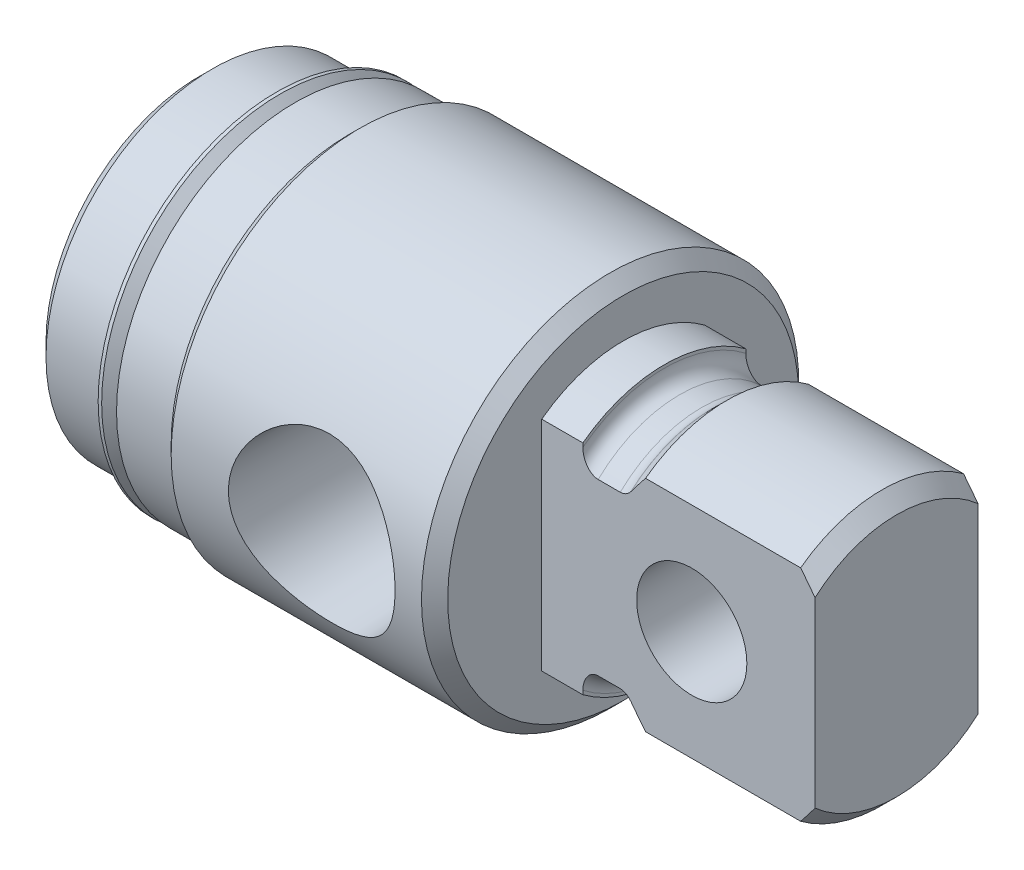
ISO-10303-21;
HEADER;
FILE_DESCRIPTION(('STEP AP214'),'2;1');
FILE_NAME('part.step','',(''),(''),'','','');
FILE_SCHEMA(('AUTOMOTIVE_DESIGN { 1 0 10303 214 1 1 1 1 }'));
ENDSEC;
DATA;
#1=APPLICATION_CONTEXT('core data for automotive mechanical design processes');
#2=APPLICATION_PROTOCOL_DEFINITION('international standard','automotive_design',2000,#1);
#3=PRODUCT_CONTEXT('',#1,'mechanical');
#4=PRODUCT('Part','Part','',(#3));
#5=PRODUCT_RELATED_PRODUCT_CATEGORY('part','',(#4));
#6=PRODUCT_DEFINITION_FORMATION('','',#4);
#7=PRODUCT_DEFINITION_CONTEXT('part definition',#1,'design');
#8=PRODUCT_DEFINITION('design','',#6,#7);
#9=PRODUCT_DEFINITION_SHAPE('','',#8);
#10=(LENGTH_UNIT() NAMED_UNIT(*) SI_UNIT(.MILLI.,.METRE.));
#11=(NAMED_UNIT(*) PLANE_ANGLE_UNIT() SI_UNIT($,.RADIAN.));
#12=(NAMED_UNIT(*) SI_UNIT($,.STERADIAN.) SOLID_ANGLE_UNIT());
#13=UNCERTAINTY_MEASURE_WITH_UNIT(LENGTH_MEASURE(1.E-05),#10,'distance_accuracy_value','');
#14=(GEOMETRIC_REPRESENTATION_CONTEXT(3) GLOBAL_UNCERTAINTY_ASSIGNED_CONTEXT((#13)) GLOBAL_UNIT_ASSIGNED_CONTEXT((#10,
#11,#12)) REPRESENTATION_CONTEXT('',''));
#15=CARTESIAN_POINT('',(0.,0.,0.));
#16=DIRECTION('',(0.,0.,1.));
#17=DIRECTION('',(1.,0.,0.));
#18=AXIS2_PLACEMENT_3D('',#15,#16,#17);
#19=CARTESIAN_POINT('',(5.35031024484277,0.,0.));
#20=DIRECTION('',(1.,0.,0.));
#21=DIRECTION('',(0.,0.,-1.));
#22=AXIS2_PLACEMENT_3D('',#19,#20,#21);
#23=TOROIDAL_SURFACE('',#22,9.25736536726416,0.127000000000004);
#24=CARTESIAN_POINT('',(5.44011280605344,0.,0.));
#25=DIRECTION('',(1.,0.,0.));
#26=DIRECTION('',(0.,0.,-1.));
#27=AXIS2_PLACEMENT_3D('',#24,#25,#26);
#28=CIRCLE('',#27,9.16756280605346);
#29=CARTESIAN_POINT('',(5.44011280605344,0.,-9.16756280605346));
#30=VERTEX_POINT('',#29);
#31=EDGE_CURVE('E216',#30,#30,#28,.F.);
#32=ORIENTED_EDGE('',*,*,#31,.F.);
#33=EDGE_LOOP('',(#32));
#34=FACE_BOUND('',#33,.T.);
#35=CARTESIAN_POINT('',(5.44011280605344,0.,0.));
#36=DIRECTION('',(-1.,0.,0.));
#37=DIRECTION('',(0.,0.,1.));
#38=AXIS2_PLACEMENT_3D('',#35,#36,#37);
#39=CIRCLE('',#38,9.34716792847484);
#40=CARTESIAN_POINT('',(5.44011280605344,0.,9.34716792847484));
#41=VERTEX_POINT('',#40);
#42=EDGE_CURVE('E219',#41,#41,#39,.T.);
#43=ORIENTED_EDGE('',*,*,#42,.T.);
#44=EDGE_LOOP('',(#43));
#45=FACE_BOUND('',#44,.T.);
#46=ADVANCED_FACE('F25',(#34,#45),#23,.F.);
#47=CARTESIAN_POINT('',(5.44011280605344,0.,0.));
#48=DIRECTION('',(1.,0.,0.));
#49=DIRECTION('',(0.,0.,-1.));
#50=AXIS2_PLACEMENT_3D('',#47,#48,#49);
#51=CONICAL_SURFACE('',#50,9.16756280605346,0.785398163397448);
#52=ORIENTED_EDGE('',*,*,#31,.T.);
#53=EDGE_LOOP('',(#52));
#54=FACE_BOUND('',#53,.T.);
#55=CARTESIAN_POINT('',(5.1816,0.,0.));
#56=DIRECTION('',(-1.,0.,0.));
#57=DIRECTION('',(0.,0.,1.));
#58=AXIS2_PLACEMENT_3D('',#55,#56,#57);
#59=CIRCLE('',#58,8.90905);
#60=CARTESIAN_POINT('',(5.1816,0.,8.90905));
#61=VERTEX_POINT('',#60);
#62=EDGE_CURVE('E196',#61,#61,#59,.T.);
#63=ORIENTED_EDGE('',*,*,#62,.F.);
#64=EDGE_LOOP('',(#63));
#65=FACE_BOUND('',#64,.T.);
#66=ADVANCED_FACE('F548',(#54,#65),#51,.T.);
#67=CARTESIAN_POINT('',(4.4955489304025,0.,0.));
#68=DIRECTION('',(-1.,0.,0.));
#69=DIRECTION('',(0.,0.,1.));
#70=AXIS2_PLACEMENT_3D('',#67,#68,#69);
#71=CONICAL_SURFACE('',#70,10.2917318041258,0.785398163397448);
#72=CARTESIAN_POINT('',(4.4955489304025,0.,0.));
#73=DIRECTION('',(-1.,0.,0.));
#74=DIRECTION('',(0.,0.,1.));
#75=AXIS2_PLACEMENT_3D('',#72,#73,#74);
#76=CIRCLE('',#75,10.2917318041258);
#77=CARTESIAN_POINT('',(4.4955489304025,0.,10.2917318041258));
#78=VERTEX_POINT('',#77);
#79=EDGE_CURVE('E424',#78,#78,#76,.F.);
#80=ORIENTED_EDGE('',*,*,#79,.F.);
#81=EDGE_LOOP('',(#80));
#82=FACE_BOUND('',#81,.T.);
#83=ORIENTED_EDGE('',*,*,#42,.F.);
#84=EDGE_LOOP('',(#83));
#85=FACE_BOUND('',#84,.T.);
#86=ADVANCED_FACE('F546',(#82,#85),#71,.F.);
#87=CARTESIAN_POINT('',(24.6126,0.,0.));
#88=DIRECTION('',(-1.,0.,0.));
#89=DIRECTION('',(0.,0.,1.));
#90=AXIS2_PLACEMENT_3D('',#87,#88,#89);
#91=CYLINDRICAL_SURFACE('',#90,8.90905);
#92=CARTESIAN_POINT('',(4.8006,0.,0.));
#93=DIRECTION('',(-1.,0.,0.));
#94=DIRECTION('',(0.,0.,1.));
#95=AXIS2_PLACEMENT_3D('',#92,#93,#94);
#96=CIRCLE('',#95,8.90905);
#97=CARTESIAN_POINT('',(4.8006,0.,8.90905));
#98=VERTEX_POINT('',#97);
#99=EDGE_CURVE('E420',#98,#98,#96,.T.);
#100=ORIENTED_EDGE('',*,*,#99,.F.);
#101=EDGE_LOOP('',(#100));
#102=FACE_BOUND('',#101,.T.);
#103=ORIENTED_EDGE('',*,*,#62,.T.);
#104=EDGE_LOOP('',(#103));
#105=FACE_BOUND('',#104,.T.);
#106=ADVANCED_FACE('F530',(#102,#105),#91,.T.);
#107=CARTESIAN_POINT('',(29.1719,0.,0.));
#108=DIRECTION('',(1.,0.,0.));
#109=DIRECTION('',(0.,0.,-1.));
#110=AXIS2_PLACEMENT_3D('',#107,#108,#109);
#111=TOROIDAL_SURFACE('',#110,7.72794999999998,0.88899999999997);
#112=CARTESIAN_POINT('',(29.1719,0.,0.));
#113=DIRECTION('',(-1.,0.,0.));
#114=DIRECTION('',(0.,0.,1.));
#115=AXIS2_PLACEMENT_3D('',#112,#113,#114);
#116=CIRCLE('',#115,6.83895);
#117=CARTESIAN_POINT('',(29.1719,4.93874898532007,4.73075));
#118=VERTEX_POINT('',#117);
#119=CARTESIAN_POINT('',(29.1719,4.93874898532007,-4.73075));
#120=VERTEX_POINT('',#119);
#121=EDGE_CURVE('E192',#118,#120,#116,.T.);
#122=ORIENTED_EDGE('',*,*,#121,.F.);
#123=CARTESIAN_POINT('',(29.7705929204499,5.25507076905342,4.73075));
#124=CARTESIAN_POINT('',(29.7397315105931,5.21723197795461,4.73075));
#125=CARTESIAN_POINT('',(29.7061992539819,5.18131810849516,4.73075));
#126=CARTESIAN_POINT('',(29.6337172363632,5.11470482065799,4.73075));
#127=CARTESIAN_POINT('',(29.5947170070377,5.08406069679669,4.73075));
#128=CARTESIAN_POINT('',(29.5190381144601,5.03484747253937,4.73075));
#129=CARTESIAN_POINT('',(29.4831313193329,5.01510572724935,4.73075));
#130=CARTESIAN_POINT('',(29.4087070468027,4.981925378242,4.73075));
#131=CARTESIAN_POINT('',(29.3702061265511,4.96845046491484,4.73075));
#132=CARTESIAN_POINT('',(29.3049320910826,4.95205818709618,4.73075));
#133=CARTESIAN_POINT('',(29.2786601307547,4.94710541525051,4.73075));
#134=CARTESIAN_POINT('',(29.2255683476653,4.94043301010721,4.73075));
#135=CARTESIAN_POINT('',(29.1987463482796,4.93873078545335,4.73075));
#136=CARTESIAN_POINT('',(29.1719,4.93874898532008,4.73075));
#137=B_SPLINE_CURVE_WITH_KNOTS('',3,(#123,#124,#125,#126,#127,#128,#129,#130,#131,#132,#133,
#134,#135,#136),.UNSPECIFIED.,.F.,.F.,(4,2,2,2,2,2,4),(0.,0.146689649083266,0.294835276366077,
0.417268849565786,0.538983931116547,0.618998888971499,0.69944118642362),.UNSPECIFIED.);
#138=CARTESIAN_POINT('',(29.7705929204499,5.25507076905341,4.73075));
#139=VERTEX_POINT('',#138);
#140=EDGE_CURVE('E29',#139,#118,#137,.T.);
#141=ORIENTED_EDGE('',*,*,#140,.F.);
#142=CARTESIAN_POINT('',(29.77059292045,0.,0.));
#143=DIRECTION('',(1.,0.,0.));
#144=DIRECTION('',(0.,0.,-1.));
#145=AXIS2_PLACEMENT_3D('',#142,#143,#144);
#146=CIRCLE('',#145,7.07076829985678);
#147=CARTESIAN_POINT('',(29.7705929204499,5.25507076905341,-4.73075));
#148=VERTEX_POINT('',#147);
#149=EDGE_CURVE('E189',#148,#139,#146,.T.);
#150=ORIENTED_EDGE('',*,*,#149,.F.);
#151=CARTESIAN_POINT('',(29.1719,4.93874898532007,-4.73075));
#152=CARTESIAN_POINT('',(29.1923112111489,4.93874476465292,-4.73075));
#153=CARTESIAN_POINT('',(29.2127096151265,4.93972327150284,-4.73075));
#154=CARTESIAN_POINT('',(29.2533071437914,4.94359740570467,-4.73075));
#155=CARTESIAN_POINT('',(29.2735064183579,4.94649145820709,-4.73075));
#156=CARTESIAN_POINT('',(29.3331338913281,4.95788871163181,-4.73075));
#157=CARTESIAN_POINT('',(29.3720692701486,4.96910959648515,-4.73075));
#158=CARTESIAN_POINT('',(29.4473113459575,4.99790587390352,-4.73075));
#159=CARTESIAN_POINT('',(29.4836254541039,5.01546243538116,-4.73075));
#160=CARTESIAN_POINT('',(29.5533163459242,5.05593210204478,-4.73075));
#161=CARTESIAN_POINT('',(29.5866795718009,5.07886832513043,-4.73075));
#162=CARTESIAN_POINT('',(29.6465305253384,5.12625310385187,-4.73075));
#163=CARTESIAN_POINT('',(29.6733712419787,5.15026346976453,-4.73075));
#164=CARTESIAN_POINT('',(29.7241157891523,5.20086377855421,-4.73075));
#165=CARTESIAN_POINT('',(29.7480398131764,5.2274333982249,-4.73075));
#166=CARTESIAN_POINT('',(29.7705929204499,5.25507076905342,-4.73075));
#167=B_SPLINE_CURVE_WITH_KNOTS('',3,(#151,#152,#153,#154,#155,#156,#157,#158,#159,#160,#161,
#162,#163,#164,#165,#166),.UNSPECIFIED.,.F.,.F.,(4,2,2,2,2,2,2,4),(0.,0.0611860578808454,
0.122321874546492,0.243183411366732,0.363688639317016,0.484721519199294,0.592546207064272,
0.699575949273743),.UNSPECIFIED.);
#168=EDGE_CURVE('E195',#120,#148,#167,.T.);
#169=ORIENTED_EDGE('',*,*,#168,.F.);
#170=EDGE_LOOP('',(#122,#141,#150,#169));
#171=FACE_BOUND('',#170,.T.);
#172=ADVANCED_FACE('F186',(#171),#111,.F.);
#173=CARTESIAN_POINT('',(29.8005179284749,0.,0.));
#174=DIRECTION('',(1.,0.,0.));
#175=DIRECTION('',(0.,1.,0.));
#176=AXIS2_PLACEMENT_3D('',#173,#174,#175);
#177=CONICAL_SURFACE('',#176,7.09802999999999,0.738859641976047);
#178=CARTESIAN_POINT('',(29.77059292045,5.2550707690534,4.73075));
#179=CARTESIAN_POINT('',(29.7755757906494,5.26117856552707,4.73075));
#180=CARTESIAN_POINT('',(29.7805609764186,5.26728446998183,4.73075));
#181=CARTESIAN_POINT('',(29.7905359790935,5.27949249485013,4.73075));
#182=CARTESIAN_POINT('',(29.7955257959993,5.28559461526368,4.73075));
#183=CARTESIAN_POINT('',(29.8005179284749,5.29169484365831,4.73075));
#184=B_SPLINE_CURVE_WITH_KNOTS('',3,(#178,#179,#180,#181,#182,#183),.UNSPECIFIED.,.F.,.F.,(4,2,
4),(0.,0.0236475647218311,0.0472951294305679),.UNSPECIFIED.);
#185=CARTESIAN_POINT('',(29.8005179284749,5.29169484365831,4.73075));
#186=VERTEX_POINT('',#185);
#187=EDGE_CURVE('E198',#139,#186,#184,.T.);
#188=ORIENTED_EDGE('',*,*,#187,.T.);
#189=CARTESIAN_POINT('',(29.8005179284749,0.,0.));
#190=DIRECTION('',(1.,0.,0.));
#191=DIRECTION('',(0.,0.,-1.));
#192=AXIS2_PLACEMENT_3D('',#189,#190,#191);
#193=CIRCLE('',#192,7.09803);
#194=CARTESIAN_POINT('',(29.8005179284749,5.29169484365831,-4.73075));
#195=VERTEX_POINT('',#194);
#196=EDGE_CURVE('E536',#195,#186,#193,.T.);
#197=ORIENTED_EDGE('',*,*,#196,.F.);
#198=CARTESIAN_POINT('',(29.8005179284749,5.29169484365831,-4.73075));
#199=CARTESIAN_POINT('',(29.7955257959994,5.28559461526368,-4.73075));
#200=CARTESIAN_POINT('',(29.7905359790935,5.27949249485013,-4.73075));
#201=CARTESIAN_POINT('',(29.7805609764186,5.26728446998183,-4.73075));
#202=CARTESIAN_POINT('',(29.7755757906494,5.26117856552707,-4.73075));
#203=CARTESIAN_POINT('',(29.77059292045,5.2550707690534,-4.73075));
#204=B_SPLINE_CURVE_WITH_KNOTS('',3,(#198,#199,#200,#201,#202,#203),.UNSPECIFIED.,.F.,.F.,(4,2,
4),(0.,0.0236475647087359,0.0472951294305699),.UNSPECIFIED.);
#205=EDGE_CURVE('E209',#195,#148,#204,.T.);
#206=ORIENTED_EDGE('',*,*,#205,.T.);
#207=ORIENTED_EDGE('',*,*,#149,.T.);
#208=EDGE_LOOP('',(#188,#197,#206,#207));
#209=FACE_BOUND('',#208,.T.);
#210=ADVANCED_FACE('F208',(#209),#177,.T.);
#211=CARTESIAN_POINT('',(29.8005179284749,0.,0.));
#212=DIRECTION('',(1.,0.,0.));
#213=DIRECTION('',(0.,1.,0.));
#214=AXIS2_PLACEMENT_3D('',#211,#212,#213);
#215=CONICAL_SURFACE('',#214,7.09802999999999,0.738859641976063);
#216=CARTESIAN_POINT('',(29.77059292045,-5.2550707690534,-4.73075));
#217=CARTESIAN_POINT('',(29.7755757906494,-5.26117856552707,-4.73075));
#218=CARTESIAN_POINT('',(29.7805609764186,-5.26728446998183,-4.73075));
#219=CARTESIAN_POINT('',(29.7905359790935,-5.27949249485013,-4.73075));
#220=CARTESIAN_POINT('',(29.7955257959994,-5.28559461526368,-4.73075));
#221=CARTESIAN_POINT('',(29.8005179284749,-5.29169484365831,-4.73075));
#222=B_SPLINE_CURVE_WITH_KNOTS('',3,(#216,#217,#218,#219,#220,#221),.UNSPECIFIED.,.F.,.F.,(4,2,
4),(0.,0.0236475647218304,0.0472951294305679),.UNSPECIFIED.);
#223=CARTESIAN_POINT('',(29.7705929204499,-5.25507076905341,-4.73075));
#224=VERTEX_POINT('',#223);
#225=CARTESIAN_POINT('',(29.8005179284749,-5.29169484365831,-4.73075));
#226=VERTEX_POINT('',#225);
#227=EDGE_CURVE('E456',#224,#226,#222,.T.);
#228=ORIENTED_EDGE('',*,*,#227,.T.);
#229=CARTESIAN_POINT('',(29.8005179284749,0.,0.));
#230=DIRECTION('',(1.,0.,0.));
#231=DIRECTION('',(0.,0.,-1.));
#232=AXIS2_PLACEMENT_3D('',#229,#230,#231);
#233=CIRCLE('',#232,7.09803);
#234=CARTESIAN_POINT('',(29.8005179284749,-5.29169484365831,4.73075));
#235=VERTEX_POINT('',#234);
#236=EDGE_CURVE('E726',#235,#226,#233,.T.);
#237=ORIENTED_EDGE('',*,*,#236,.F.);
#238=CARTESIAN_POINT('',(29.8005179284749,-5.29169484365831,4.73075));
#239=CARTESIAN_POINT('',(29.7955257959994,-5.28559461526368,4.73075));
#240=CARTESIAN_POINT('',(29.7905359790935,-5.27949249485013,4.73075));
#241=CARTESIAN_POINT('',(29.7805609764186,-5.26728446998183,4.73075));
#242=CARTESIAN_POINT('',(29.7755757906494,-5.26117856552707,4.73075));
#243=CARTESIAN_POINT('',(29.77059292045,-5.2550707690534,4.73075));
#244=B_SPLINE_CURVE_WITH_KNOTS('',3,(#238,#239,#240,#241,#242,#243),.UNSPECIFIED.,.F.,.F.,(4,2,
4),(0.,0.0236475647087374,0.0472951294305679),.UNSPECIFIED.);
#245=CARTESIAN_POINT('',(29.7705929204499,-5.25507076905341,4.73075));
#246=VERTEX_POINT('',#245);
#247=EDGE_CURVE('E206',#235,#246,#244,.T.);
#248=ORIENTED_EDGE('',*,*,#247,.T.);
#249=CARTESIAN_POINT('',(29.7705929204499,0.,0.));
#250=DIRECTION('',(1.,0.,0.));
#251=DIRECTION('',(0.,0.,-1.));
#252=AXIS2_PLACEMENT_3D('',#249,#250,#251);
#253=CIRCLE('',#252,7.0707682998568);
#254=EDGE_CURVE('E429',#246,#224,#253,.T.);
#255=ORIENTED_EDGE('',*,*,#254,.T.);
#256=EDGE_LOOP('',(#228,#237,#248,#255));
#257=FACE_BOUND('',#256,.T.);
#258=ADVANCED_FACE('F438',(#257),#215,.T.);
#259=CARTESIAN_POINT('',(29.1719,0.,0.));
#260=DIRECTION('',(1.,0.,0.));
#261=DIRECTION('',(0.,0.,-1.));
#262=AXIS2_PLACEMENT_3D('',#259,#260,#261);
#263=TOROIDAL_SURFACE('',#262,7.72794999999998,0.88899999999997);
#264=CARTESIAN_POINT('',(29.1718999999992,0.,0.));
#265=DIRECTION('',(-1.,0.,0.));
#266=DIRECTION('',(0.,0.,1.));
#267=AXIS2_PLACEMENT_3D('',#264,#265,#266);
#268=CIRCLE('',#267,6.83895);
#269=CARTESIAN_POINT('',(29.1718999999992,-4.93874898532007,-4.73075));
#270=VERTEX_POINT('',#269);
#271=CARTESIAN_POINT('',(29.1718999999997,-4.9387489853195,4.7307500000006));
#272=VERTEX_POINT('',#271);
#273=EDGE_CURVE('E416',#270,#272,#268,.T.);
#274=ORIENTED_EDGE('',*,*,#273,.F.);
#275=CARTESIAN_POINT('',(29.7705929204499,-5.25507076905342,-4.73075));
#276=CARTESIAN_POINT('',(29.7397315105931,-5.21723197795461,-4.73075));
#277=CARTESIAN_POINT('',(29.7061992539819,-5.18131810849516,-4.73075));
#278=CARTESIAN_POINT('',(29.6337172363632,-5.11470482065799,-4.73075));
#279=CARTESIAN_POINT('',(29.5947170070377,-5.08406069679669,-4.73075));
#280=CARTESIAN_POINT('',(29.5190381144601,-5.03484747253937,-4.73075));
#281=CARTESIAN_POINT('',(29.4831313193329,-5.01510572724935,-4.73075));
#282=CARTESIAN_POINT('',(29.4087070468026,-4.981925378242,-4.73075));
#283=CARTESIAN_POINT('',(29.3702061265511,-4.96845046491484,-4.73075));
#284=CARTESIAN_POINT('',(29.3049320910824,-4.95205818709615,-4.73075));
#285=CARTESIAN_POINT('',(29.2786601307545,-4.94710541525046,-4.73075));
#286=CARTESIAN_POINT('',(29.2255683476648,-4.94043301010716,-4.73075));
#287=CARTESIAN_POINT('',(29.1987463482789,-4.93873078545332,-4.73075));
#288=CARTESIAN_POINT('',(29.1718999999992,-4.93874898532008,-4.73075));
#289=B_SPLINE_CURVE_WITH_KNOTS('',3,(#275,#276,#277,#278,#279,#280,#281,#282,#283,#284,#285,
#286,#287,#288),.UNSPECIFIED.,.F.,.F.,(4,2,2,2,2,2,4),(0.,0.146689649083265,0.294835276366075,
0.417268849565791,0.538983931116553,0.618998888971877,0.69944118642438),.UNSPECIFIED.);
#290=EDGE_CURVE('E451',#224,#270,#289,.T.);
#291=ORIENTED_EDGE('',*,*,#290,.F.);
#292=ORIENTED_EDGE('',*,*,#254,.F.);
#293=CARTESIAN_POINT('',(29.1719000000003,-4.93874898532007,4.73075));
#294=CARTESIAN_POINT('',(29.1923112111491,-4.93874476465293,4.73075));
#295=CARTESIAN_POINT('',(29.2127096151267,-4.93972327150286,4.73075));
#296=CARTESIAN_POINT('',(29.2533071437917,-4.9435974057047,4.73075));
#297=CARTESIAN_POINT('',(29.2735064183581,-4.94649145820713,4.73075));
#298=CARTESIAN_POINT('',(29.3331338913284,-4.95788871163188,4.73075));
#299=CARTESIAN_POINT('',(29.3720692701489,-4.96910959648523,4.73075));
#300=CARTESIAN_POINT('',(29.4473113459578,-4.99790587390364,4.73075));
#301=CARTESIAN_POINT('',(29.4836254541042,-5.0154624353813,4.73075));
#302=CARTESIAN_POINT('',(29.5533163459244,-5.05593210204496,4.73075));
#303=CARTESIAN_POINT('',(29.5866795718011,-5.07886832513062,4.73075));
#304=CARTESIAN_POINT('',(29.6465305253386,-5.12625310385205,4.73075));
#305=CARTESIAN_POINT('',(29.6733712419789,-5.15026346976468,4.73075));
#306=CARTESIAN_POINT('',(29.7241157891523,-5.20086377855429,4.73075));
#307=CARTESIAN_POINT('',(29.7480398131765,-5.22743339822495,4.73075));
#308=CARTESIAN_POINT('',(29.7705929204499,-5.25507076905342,4.73075));
#309=B_SPLINE_CURVE_WITH_KNOTS('',3,(#293,#294,#295,#296,#297,#298,#299,#300,#301,#302,#303,
#304,#305,#306,#307,#308),.UNSPECIFIED.,.F.,.F.,(4,2,2,2,2,2,2,4),(0.,0.061186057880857,
0.122321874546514,0.243183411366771,0.363688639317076,0.484721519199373,0.592546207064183,
0.699575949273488),.UNSPECIFIED.);
#310=EDGE_CURVE('E445',#272,#246,#309,.T.);
#311=ORIENTED_EDGE('',*,*,#310,.F.);
#312=EDGE_LOOP('',(#274,#291,#292,#311));
#313=FACE_BOUND('',#312,.T.);
#314=ADVANCED_FACE('F432',(#313),#263,.F.);
#315=CARTESIAN_POINT('',(4.4955489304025,10.3759,0.));
#316=DIRECTION('',(-1.,0.,0.));
#317=DIRECTION('',(0.,0.,1.));
#318=AXIS2_PLACEMENT_3D('',#315,#316,#317);
#319=PLANE('',#318);
#320=CARTESIAN_POINT('',(4.4955489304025,0.,0.));
#321=DIRECTION('',(-1.,0.,0.));
#322=DIRECTION('',(0.,0.,1.));
#323=AXIS2_PLACEMENT_3D('',#320,#321,#322);
#324=CIRCLE('',#323,10.3759);
#325=CARTESIAN_POINT('',(4.4955489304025,0.,10.3759));
#326=VERTEX_POINT('',#325);
#327=EDGE_CURVE('E640',#326,#326,#324,.F.);
#328=ORIENTED_EDGE('',*,*,#327,.F.);
#329=EDGE_LOOP('',(#328));
#330=FACE_BOUND('',#329,.T.);
#331=ORIENTED_EDGE('',*,*,#79,.T.);
#332=EDGE_LOOP('',(#331));
#333=FACE_BOUND('',#332,.T.);
#334=ADVANCED_FACE('F437',(#330,#333),#319,.T.);
#335=CARTESIAN_POINT('',(4.0386,0.,0.));
#336=DIRECTION('',(-1.,0.,0.));
#337=DIRECTION('',(0.,0.,1.));
#338=AXIS2_PLACEMENT_3D('',#335,#336,#337);
#339=CONICAL_SURFACE('',#338,9.67105,0.785398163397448);
#340=CARTESIAN_POINT('',(4.0386,0.,0.));
#341=DIRECTION('',(-1.,0.,0.));
#342=DIRECTION('',(0.,0.,1.));
#343=AXIS2_PLACEMENT_3D('',#340,#341,#342);
#344=CIRCLE('',#343,9.67105);
#345=CARTESIAN_POINT('',(4.0386,0.,9.67105));
#346=VERTEX_POINT('',#345);
#347=EDGE_CURVE('E633',#346,#346,#344,.T.);
#348=ORIENTED_EDGE('',*,*,#347,.F.);
#349=EDGE_LOOP('',(#348));
#350=FACE_BOUND('',#349,.T.);
#351=ORIENTED_EDGE('',*,*,#99,.T.);
#352=EDGE_LOOP('',(#351));
#353=FACE_BOUND('',#352,.T.);
#354=ADVANCED_FACE('F622',(#350,#353),#339,.T.);
#355=CARTESIAN_POINT('',(40.4876,0.,0.));
#356=DIRECTION('',(-1.,0.,0.));
#357=DIRECTION('',(0.,0.,1.));
#358=AXIS2_PLACEMENT_3D('',#355,#356,#357);
#359=CYLINDRICAL_SURFACE('',#358,6.83895);
#360=DIRECTION('',(-1.,0.,0.));
#361=VECTOR('',#360,1.);
#362=CARTESIAN_POINT('',(40.4876,4.93874898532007,4.73075));
#363=LINE('',#362,#361);
#364=CARTESIAN_POINT('',(27.8892,4.93874898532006,4.73075));
#365=VERTEX_POINT('',#364);
#366=EDGE_CURVE('E419',#365,#118,#363,.F.);
#367=ORIENTED_EDGE('',*,*,#366,.T.);
#368=ORIENTED_EDGE('',*,*,#121,.T.);
#369=DIRECTION('',(-1.,0.,0.));
#370=VECTOR('',#369,1.);
#371=CARTESIAN_POINT('',(40.4876,4.93874898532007,-4.73075));
#372=LINE('',#371,#370);
#373=CARTESIAN_POINT('',(27.8892,4.93874898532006,-4.73075));
#374=VERTEX_POINT('',#373);
#375=EDGE_CURVE('E417',#120,#374,#372,.T.);
#376=ORIENTED_EDGE('',*,*,#375,.T.);
#377=CARTESIAN_POINT('',(27.8892,0.,0.));
#378=DIRECTION('',(1.,0.,0.));
#379=DIRECTION('',(0.,0.,-1.));
#380=AXIS2_PLACEMENT_3D('',#377,#378,#379);
#381=CIRCLE('',#380,6.83894999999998);
#382=EDGE_CURVE('E642',#374,#365,#381,.T.);
#383=ORIENTED_EDGE('',*,*,#382,.T.);
#384=EDGE_LOOP('',(#367,#368,#376,#383));
#385=FACE_BOUND('',#384,.T.);
#386=ADVANCED_FACE('F617',(#385),#359,.T.);
#387=CARTESIAN_POINT('',(30.6399879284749,0.,0.));
#388=DIRECTION('',(1.,0.,0.));
#389=DIRECTION('',(0.,1.,0.));
#390=AXIS2_PLACEMENT_3D('',#387,#388,#389);
#391=CONICAL_SURFACE('',#390,7.93750000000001,0.78539816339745);
#392=CARTESIAN_POINT('',(29.8005179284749,5.29169484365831,4.73075));
#393=CARTESIAN_POINT('',(29.8687376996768,5.38319681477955,4.73075));
#394=CARTESIAN_POINT('',(29.9374572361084,5.47432459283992,4.73075));
#395=CARTESIAN_POINT('',(30.075790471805,5.65588763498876,4.73075));
#396=CARTESIAN_POINT('',(30.1454040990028,5.74632295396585,4.73075));
#397=CARTESIAN_POINT('',(30.285430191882,5.92657040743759,4.73075));
#398=CARTESIAN_POINT('',(30.3558426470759,6.01638255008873,4.73075));
#399=CARTESIAN_POINT('',(30.4973927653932,6.19544536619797,4.73075));
#400=CARTESIAN_POINT('',(30.5685304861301,6.28469599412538,4.73075));
#401=CARTESIAN_POINT('',(30.6399879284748,6.37368893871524,4.73075));
#402=B_SPLINE_CURVE_WITH_KNOTS('',3,(#392,#393,#394,#395,#396,#397,#398,#399,#400,#401),
.UNSPECIFIED.,.F.,.F.,(4,2,2,2,4),(0.,0.342398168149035,0.684768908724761,1.02713515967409,
1.36952882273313),.UNSPECIFIED.);
#403=CARTESIAN_POINT('',(30.6399879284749,6.37368893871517,4.73075));
#404=VERTEX_POINT('',#403);
#405=EDGE_CURVE('E202',#186,#404,#402,.T.);
#406=ORIENTED_EDGE('',*,*,#405,.T.);
#407=CARTESIAN_POINT('',(30.6399879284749,0.,0.));
#408=DIRECTION('',(-1.,0.,0.));
#409=DIRECTION('',(0.,0.,1.));
#410=AXIS2_PLACEMENT_3D('',#407,#408,#409);
#411=CIRCLE('',#410,7.9375);
#412=CARTESIAN_POINT('',(30.6399879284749,6.37368893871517,-4.73075));
#413=VERTEX_POINT('',#412);
#414=EDGE_CURVE('E677',#413,#404,#411,.F.);
#415=ORIENTED_EDGE('',*,*,#414,.F.);
#416=CARTESIAN_POINT('',(30.6399879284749,6.37368893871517,-4.73075));
#417=CARTESIAN_POINT('',(30.5685304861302,6.28469599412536,-4.73075));
#418=CARTESIAN_POINT('',(30.4973927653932,6.19544536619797,-4.73075));
#419=CARTESIAN_POINT('',(30.3558426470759,6.01638255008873,-4.73075));
#420=CARTESIAN_POINT('',(30.285430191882,5.9265704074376,-4.73075));
#421=CARTESIAN_POINT('',(30.1454040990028,5.74632295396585,-4.73075));
#422=CARTESIAN_POINT('',(30.075790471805,5.65588763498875,-4.73075));
#423=CARTESIAN_POINT('',(29.9374572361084,5.47432459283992,-4.73075));
#424=CARTESIAN_POINT('',(29.8687376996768,5.38319681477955,-4.73075));
#425=CARTESIAN_POINT('',(29.8005179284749,5.29169484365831,-4.73075));
#426=B_SPLINE_CURVE_WITH_KNOTS('',3,(#416,#417,#418,#419,#420,#421,#422,#423,#424,#425),
.UNSPECIFIED.,.F.,.F.,(4,2,2,2,4),(0.,0.342393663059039,0.684759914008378,1.02713065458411,
1.36952882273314),.UNSPECIFIED.);
#427=EDGE_CURVE('E508',#413,#195,#426,.T.);
#428=ORIENTED_EDGE('',*,*,#427,.T.);
#429=ORIENTED_EDGE('',*,*,#196,.T.);
#430=EDGE_LOOP('',(#406,#415,#428,#429));
#431=FACE_BOUND('',#430,.T.);
#432=ADVANCED_FACE('F612',(#431),#391,.T.);
#433=CARTESIAN_POINT('',(39.64813,0.,0.));
#434=DIRECTION('',(-1.,0.,0.));
#435=DIRECTION('',(0.,0.,1.));
#436=AXIS2_PLACEMENT_3D('',#433,#434,#435);
#437=CONICAL_SURFACE('',#436,7.93750000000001,0.785398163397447);
#438=CARTESIAN_POINT('',(39.64813,6.37368893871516,4.73075));
#439=CARTESIAN_POINT('',(39.7195874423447,6.28469599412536,4.73075));
#440=CARTESIAN_POINT('',(39.7907251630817,6.19544536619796,4.73075));
#441=CARTESIAN_POINT('',(39.932275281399,6.01638255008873,4.73075));
#442=CARTESIAN_POINT('',(40.0026877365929,5.9265704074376,4.73075));
#443=CARTESIAN_POINT('',(40.142713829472,5.74632295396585,4.73075));
#444=CARTESIAN_POINT('',(40.2123274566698,5.65588763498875,4.73075));
#445=CARTESIAN_POINT('',(40.3506606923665,5.47432459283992,4.73075));
#446=CARTESIAN_POINT('',(40.4193802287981,5.38319681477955,4.73075));
#447=CARTESIAN_POINT('',(40.4876,5.29169484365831,4.73075));
#448=B_SPLINE_CURVE_WITH_KNOTS('',3,(#438,#439,#440,#441,#442,#443,#444,#445,#446,#447),
.UNSPECIFIED.,.F.,.F.,(4,2,2,2,4),(0.,0.342393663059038,0.684759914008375,1.0271306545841,
1.36952882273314),.UNSPECIFIED.);
#449=CARTESIAN_POINT('',(39.64813,6.37368893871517,4.73075));
#450=VERTEX_POINT('',#449);
#451=CARTESIAN_POINT('',(40.4876,5.29169484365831,4.73075));
#452=VERTEX_POINT('',#451);
#453=EDGE_CURVE('E603',#450,#452,#448,.T.);
#454=ORIENTED_EDGE('',*,*,#453,.T.);
#455=CARTESIAN_POINT('',(40.4876,0.,0.));
#456=DIRECTION('',(-1.,0.,0.));
#457=DIRECTION('',(0.,0.,1.));
#458=AXIS2_PLACEMENT_3D('',#455,#456,#457);
#459=CIRCLE('',#458,7.09803);
#460=CARTESIAN_POINT('',(40.4876,5.29169484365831,-4.73075));
#461=VERTEX_POINT('',#460);
#462=EDGE_CURVE('E747',#452,#461,#459,.T.);
#463=ORIENTED_EDGE('',*,*,#462,.T.);
#464=CARTESIAN_POINT('',(40.4876,5.29169484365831,-4.73075));
#465=CARTESIAN_POINT('',(40.4193802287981,5.38319681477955,-4.73075));
#466=CARTESIAN_POINT('',(40.3506606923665,5.47432459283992,-4.73075));
#467=CARTESIAN_POINT('',(40.2123274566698,5.65588763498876,-4.73075));
#468=CARTESIAN_POINT('',(40.142713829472,5.74632295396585,-4.73075));
#469=CARTESIAN_POINT('',(40.0026877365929,5.92657040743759,-4.73075));
#470=CARTESIAN_POINT('',(39.932275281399,6.01638255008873,-4.73075));
#471=CARTESIAN_POINT('',(39.7907251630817,6.19544536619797,-4.73075));
#472=CARTESIAN_POINT('',(39.7195874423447,6.28469599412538,-4.73075));
#473=CARTESIAN_POINT('',(39.6481300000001,6.37368893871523,-4.73075));
#474=B_SPLINE_CURVE_WITH_KNOTS('',3,(#464,#465,#466,#467,#468,#469,#470,#471,#472,#473),
.UNSPECIFIED.,.F.,.F.,(4,2,2,2,4),(0.,0.342398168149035,0.68476890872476,1.0271351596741,
1.36952882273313),.UNSPECIFIED.);
#475=CARTESIAN_POINT('',(39.64813,6.37368893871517,-4.73075));
#476=VERTEX_POINT('',#475);
#477=EDGE_CURVE('E499',#461,#476,#474,.T.);
#478=ORIENTED_EDGE('',*,*,#477,.T.);
#479=CARTESIAN_POINT('',(39.64813,0.,0.));
#480=DIRECTION('',(-1.,0.,0.));
#481=DIRECTION('',(0.,0.,1.));
#482=AXIS2_PLACEMENT_3D('',#479,#480,#481);
#483=CIRCLE('',#482,7.9375);
#484=EDGE_CURVE('E673',#450,#476,#483,.T.);
#485=ORIENTED_EDGE('',*,*,#484,.F.);
#486=EDGE_LOOP('',(#454,#463,#478,#485));
#487=FACE_BOUND('',#486,.T.);
#488=ADVANCED_FACE('F616',(#487),#437,.T.);
#489=CARTESIAN_POINT('',(30.6399879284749,0.,0.));
#490=DIRECTION('',(1.,0.,0.));
#491=DIRECTION('',(0.,1.,0.));
#492=AXIS2_PLACEMENT_3D('',#489,#490,#491);
#493=CONICAL_SURFACE('',#492,7.93750000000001,0.78539816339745);
#494=CARTESIAN_POINT('',(29.8005179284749,-5.29169484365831,-4.73075));
#495=CARTESIAN_POINT('',(29.8687376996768,-5.38319681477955,-4.73075));
#496=CARTESIAN_POINT('',(29.9374572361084,-5.47432459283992,-4.73075));
#497=CARTESIAN_POINT('',(30.075790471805,-5.65588763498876,-4.73075));
#498=CARTESIAN_POINT('',(30.1454040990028,-5.74632295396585,-4.73075));
#499=CARTESIAN_POINT('',(30.285430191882,-5.92657040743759,-4.73075));
#500=CARTESIAN_POINT('',(30.3558426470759,-6.01638255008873,-4.73075));
#501=CARTESIAN_POINT('',(30.4973927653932,-6.19544536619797,-4.73075));
#502=CARTESIAN_POINT('',(30.5685304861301,-6.28469599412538,-4.73075));
#503=CARTESIAN_POINT('',(30.6399879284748,-6.37368893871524,-4.73075));
#504=B_SPLINE_CURVE_WITH_KNOTS('',3,(#494,#495,#496,#497,#498,#499,#500,#501,#502,#503),
.UNSPECIFIED.,.F.,.F.,(4,2,2,2,4),(0.,0.342398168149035,0.684768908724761,1.0271351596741,
1.36952882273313),.UNSPECIFIED.);
#505=CARTESIAN_POINT('',(30.6399879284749,-6.37368893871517,-4.73075));
#506=VERTEX_POINT('',#505);
#507=EDGE_CURVE('E491',#226,#506,#504,.T.);
#508=ORIENTED_EDGE('',*,*,#507,.T.);
#509=CARTESIAN_POINT('',(30.6399879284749,0.,0.));
#510=DIRECTION('',(-1.,0.,0.));
#511=DIRECTION('',(0.,0.,1.));
#512=AXIS2_PLACEMENT_3D('',#509,#510,#511);
#513=CIRCLE('',#512,7.9375);
#514=CARTESIAN_POINT('',(30.6399879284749,-6.37368893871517,4.73075));
#515=VERTEX_POINT('',#514);
#516=EDGE_CURVE('E724',#515,#506,#513,.F.);
#517=ORIENTED_EDGE('',*,*,#516,.F.);
#518=CARTESIAN_POINT('',(30.6399879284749,-6.37368893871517,4.73075));
#519=CARTESIAN_POINT('',(30.5685304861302,-6.28469599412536,4.73075));
#520=CARTESIAN_POINT('',(30.4973927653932,-6.19544536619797,4.73075));
#521=CARTESIAN_POINT('',(30.3558426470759,-6.01638255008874,4.73075));
#522=CARTESIAN_POINT('',(30.285430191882,-5.9265704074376,4.73075));
#523=CARTESIAN_POINT('',(30.1454040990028,-5.74632295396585,4.73075));
#524=CARTESIAN_POINT('',(30.075790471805,-5.65588763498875,4.73075));
#525=CARTESIAN_POINT('',(29.9374572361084,-5.47432459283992,4.73075));
#526=CARTESIAN_POINT('',(29.8687376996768,-5.38319681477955,4.73075));
#527=CARTESIAN_POINT('',(29.8005179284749,-5.29169484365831,4.73075));
#528=B_SPLINE_CURVE_WITH_KNOTS('',3,(#518,#519,#520,#521,#522,#523,#524,#525,#526,#527),
.UNSPECIFIED.,.F.,.F.,(4,2,2,2,4),(0.,0.342393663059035,0.684759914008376,1.0271306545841,
1.36952882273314),.UNSPECIFIED.);
#529=EDGE_CURVE('E598',#515,#235,#528,.T.);
#530=ORIENTED_EDGE('',*,*,#529,.T.);
#531=ORIENTED_EDGE('',*,*,#236,.T.);
#532=EDGE_LOOP('',(#508,#517,#530,#531));
#533=FACE_BOUND('',#532,.T.);
#534=ADVANCED_FACE('F709',(#533),#493,.T.);
#535=CARTESIAN_POINT('',(39.64813,0.,0.));
#536=DIRECTION('',(-1.,0.,0.));
#537=DIRECTION('',(0.,0.,1.));
#538=AXIS2_PLACEMENT_3D('',#535,#536,#537);
#539=CONICAL_SURFACE('',#538,7.9375,0.785398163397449);
#540=CARTESIAN_POINT('',(39.64813,-6.37368893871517,-4.73075));
#541=CARTESIAN_POINT('',(39.7195874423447,-6.28469599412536,-4.73075));
#542=CARTESIAN_POINT('',(39.7907251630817,-6.19544536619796,-4.73075));
#543=CARTESIAN_POINT('',(39.932275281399,-6.01638255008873,-4.73075));
#544=CARTESIAN_POINT('',(40.0026877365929,-5.9265704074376,-4.73075));
#545=CARTESIAN_POINT('',(40.142713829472,-5.74632295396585,-4.73075));
#546=CARTESIAN_POINT('',(40.2123274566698,-5.65588763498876,-4.73075));
#547=CARTESIAN_POINT('',(40.3506606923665,-5.47432459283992,-4.73075));
#548=CARTESIAN_POINT('',(40.4193802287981,-5.38319681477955,-4.73075));
#549=CARTESIAN_POINT('',(40.4876,-5.29169484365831,-4.73075));
#550=B_SPLINE_CURVE_WITH_KNOTS('',3,(#540,#541,#542,#543,#544,#545,#546,#547,#548,#549),
.UNSPECIFIED.,.F.,.F.,(4,2,2,2,4),(0.,0.342393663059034,0.684759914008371,1.0271306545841,
1.36952882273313),.UNSPECIFIED.);
#551=CARTESIAN_POINT('',(39.64813,-6.37368893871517,-4.73075));
#552=VERTEX_POINT('',#551);
#553=CARTESIAN_POINT('',(40.4876,-5.29169484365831,-4.73075));
#554=VERTEX_POINT('',#553);
#555=EDGE_CURVE('E413',#552,#554,#550,.T.);
#556=ORIENTED_EDGE('',*,*,#555,.T.);
#557=CARTESIAN_POINT('',(40.4876,0.,0.));
#558=DIRECTION('',(-1.,0.,0.));
#559=DIRECTION('',(0.,0.,1.));
#560=AXIS2_PLACEMENT_3D('',#557,#558,#559);
#561=CIRCLE('',#560,7.09803);
#562=CARTESIAN_POINT('',(40.4876,-5.29169484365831,4.73075));
#563=VERTEX_POINT('',#562);
#564=EDGE_CURVE('E731',#554,#563,#561,.T.);
#565=ORIENTED_EDGE('',*,*,#564,.T.);
#566=CARTESIAN_POINT('',(40.4876,-5.29169484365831,4.73075));
#567=CARTESIAN_POINT('',(40.4193802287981,-5.38319681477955,4.73075));
#568=CARTESIAN_POINT('',(40.3506606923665,-5.47432459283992,4.73075));
#569=CARTESIAN_POINT('',(40.2123274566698,-5.65588763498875,4.73075));
#570=CARTESIAN_POINT('',(40.142713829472,-5.74632295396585,4.73075));
#571=CARTESIAN_POINT('',(40.0026877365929,-5.92657040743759,4.73075));
#572=CARTESIAN_POINT('',(39.932275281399,-6.01638255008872,4.73075));
#573=CARTESIAN_POINT('',(39.7907251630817,-6.19544536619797,4.73075));
#574=CARTESIAN_POINT('',(39.7195874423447,-6.28469599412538,4.73075));
#575=CARTESIAN_POINT('',(39.6481300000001,-6.37368893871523,4.73075));
#576=B_SPLINE_CURVE_WITH_KNOTS('',3,(#566,#567,#568,#569,#570,#571,#572,#573,#574,#575),
.UNSPECIFIED.,.F.,.F.,(4,2,2,2,4),(0.,0.34239816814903,0.684768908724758,1.0271351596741,
1.36952882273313),.UNSPECIFIED.);
#577=CARTESIAN_POINT('',(39.64813,-6.37368893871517,4.73075));
#578=VERTEX_POINT('',#577);
#579=EDGE_CURVE('E593',#563,#578,#576,.T.);
#580=ORIENTED_EDGE('',*,*,#579,.T.);
#581=CARTESIAN_POINT('',(39.64813,0.,0.));
#582=DIRECTION('',(-1.,0.,0.));
#583=DIRECTION('',(0.,0.,1.));
#584=AXIS2_PLACEMENT_3D('',#581,#582,#583);
#585=CIRCLE('',#584,7.9375);
#586=EDGE_CURVE('E730',#552,#578,#585,.T.);
#587=ORIENTED_EDGE('',*,*,#586,.F.);
#588=EDGE_LOOP('',(#556,#565,#580,#587));
#589=FACE_BOUND('',#588,.T.);
#590=ADVANCED_FACE('F705',(#589),#539,.T.);
#591=CARTESIAN_POINT('',(40.4876,0.,0.));
#592=DIRECTION('',(-1.,0.,0.));
#593=DIRECTION('',(0.,0.,1.));
#594=AXIS2_PLACEMENT_3D('',#591,#592,#593);
#595=CYLINDRICAL_SURFACE('',#594,6.83895);
#596=DIRECTION('',(-1.,0.,0.));
#597=VECTOR('',#596,1.);
#598=CARTESIAN_POINT('',(40.4876,-4.93874898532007,-4.73075));
#599=LINE('',#598,#597);
#600=CARTESIAN_POINT('',(27.8892,-4.93874898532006,-4.73075));
#601=VERTEX_POINT('',#600);
#602=EDGE_CURVE('E412',#601,#270,#599,.F.);
#603=ORIENTED_EDGE('',*,*,#602,.T.);
#604=ORIENTED_EDGE('',*,*,#273,.T.);
#605=DIRECTION('',(-1.,0.,0.));
#606=VECTOR('',#605,1.);
#607=CARTESIAN_POINT('',(40.4876,-4.93874898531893,4.73075000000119));
#608=LINE('',#607,#606);
#609=CARTESIAN_POINT('',(27.8892,-4.93874898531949,4.73075000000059));
#610=VERTEX_POINT('',#609);
#611=EDGE_CURVE('E405',#272,#610,#608,.T.);
#612=ORIENTED_EDGE('',*,*,#611,.T.);
#613=CARTESIAN_POINT('',(27.8892,0.,0.));
#614=DIRECTION('',(1.,0.,0.));
#615=DIRECTION('',(0.,0.,-1.));
#616=AXIS2_PLACEMENT_3D('',#613,#614,#615);
#617=CIRCLE('',#616,6.83894999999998);
#618=EDGE_CURVE('E738',#610,#601,#617,.T.);
#619=ORIENTED_EDGE('',*,*,#618,.T.);
#620=EDGE_LOOP('',(#603,#604,#612,#619));
#621=FACE_BOUND('',#620,.T.);
#622=ADVANCED_FACE('F702',(#621),#595,.T.);
#623=CARTESIAN_POINT('',(5.5626,0.,0.));
#624=DIRECTION('',(-1.,0.,0.));
#625=DIRECTION('',(0.,0.,1.));
#626=AXIS2_PLACEMENT_3D('',#623,#624,#625);
#627=CYLINDRICAL_SURFACE('',#626,10.3759);
#628=CARTESIAN_POINT('',(4.69874893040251,0.,0.));
#629=DIRECTION('',(-1.,0.,0.));
#630=DIRECTION('',(0.,0.,1.));
#631=AXIS2_PLACEMENT_3D('',#628,#629,#630);
#632=CIRCLE('',#631,10.3759);
#633=CARTESIAN_POINT('',(4.69874893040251,0.,10.3759));
#634=VERTEX_POINT('',#633);
#635=EDGE_CURVE('E348',#634,#634,#632,.F.);
#636=ORIENTED_EDGE('',*,*,#635,.F.);
#637=EDGE_LOOP('',(#636));
#638=FACE_BOUND('',#637,.T.);
#639=ORIENTED_EDGE('',*,*,#327,.T.);
#640=EDGE_LOOP('',(#639));
#641=FACE_BOUND('',#640,.T.);
#642=ADVANCED_FACE('F698',(#638,#641),#627,.T.);
#643=CARTESIAN_POINT('',(24.6126,0.,0.));
#644=DIRECTION('',(-1.,0.,0.));
#645=DIRECTION('',(0.,0.,1.));
#646=AXIS2_PLACEMENT_3D('',#643,#644,#645);
#647=CYLINDRICAL_SURFACE('',#646,9.67105);
#648=CARTESIAN_POINT('',(0.762000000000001,0.,0.));
#649=DIRECTION('',(1.,0.,0.));
#650=DIRECTION('',(0.,0.,-1.));
#651=AXIS2_PLACEMENT_3D('',#648,#649,#650);
#652=CIRCLE('',#651,9.67105);
#653=CARTESIAN_POINT('',(0.762,0.,-9.67105));
#654=VERTEX_POINT('',#653);
#655=EDGE_CURVE('E345',#654,#654,#652,.F.);
#656=ORIENTED_EDGE('',*,*,#655,.F.);
#657=EDGE_LOOP('',(#656));
#658=FACE_BOUND('',#657,.T.);
#659=ORIENTED_EDGE('',*,*,#347,.T.);
#660=EDGE_LOOP('',(#659));
#661=FACE_BOUND('',#660,.T.);
#662=ADVANCED_FACE('F695',(#658,#661),#647,.T.);
#663=CARTESIAN_POINT('',(27.0002,7.90575,0.));
#664=DIRECTION('',(-1.,0.,0.));
#665=DIRECTION('',(0.,0.,1.));
#666=AXIS2_PLACEMENT_3D('',#663,#664,#665);
#667=PLANE('',#666);
#668=CARTESIAN_POINT('',(27.0002,0.,0.));
#669=DIRECTION('',(-1.,0.,0.));
#670=DIRECTION('',(0.,0.,1.));
#671=AXIS2_PLACEMENT_3D('',#668,#669,#670);
#672=CIRCLE('',#671,7.90575);
#673=CARTESIAN_POINT('',(27.0002,-6.33410510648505,-4.73075));
#674=VERTEX_POINT('',#673);
#675=CARTESIAN_POINT('',(27.0002,-6.33410510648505,4.73075));
#676=VERTEX_POINT('',#675);
#677=EDGE_CURVE('E324',#674,#676,#672,.T.);
#678=ORIENTED_EDGE('',*,*,#677,.F.);
#679=DIRECTION('',(0.,1.,0.));
#680=VECTOR('',#679,1.);
#681=CARTESIAN_POINT('',(27.0002,7.90575,-4.73075));
#682=LINE('',#681,#680);
#683=CARTESIAN_POINT('',(27.0002,-6.11074591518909,-4.73075));
#684=VERTEX_POINT('',#683);
#685=EDGE_CURVE('E639',#684,#674,#682,.F.);
#686=ORIENTED_EDGE('',*,*,#685,.F.);
#687=CARTESIAN_POINT('',(27.0002,0.,0.));
#688=DIRECTION('',(1.,0.,0.));
#689=DIRECTION('',(0.,-0.790733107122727,0.612161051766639));
#690=AXIS2_PLACEMENT_3D('',#687,#688,#689);
#691=CIRCLE('',#690,7.72795000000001);
#692=CARTESIAN_POINT('',(27.0002,-6.11074591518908,4.73075));
#693=VERTEX_POINT('',#692);
#694=EDGE_CURVE('E682',#684,#693,#691,.F.);
#695=ORIENTED_EDGE('',*,*,#694,.T.);
#696=DIRECTION('',(0.,-1.,0.));
#697=VECTOR('',#696,1.);
#698=CARTESIAN_POINT('',(27.0002,21.9075,4.73075));
#699=LINE('',#698,#697);
#700=EDGE_CURVE('E339',#676,#693,#699,.F.);
#701=ORIENTED_EDGE('',*,*,#700,.F.);
#702=EDGE_LOOP('',(#678,#686,#695,#701));
#703=FACE_BOUND('',#702,.T.);
#704=ADVANCED_FACE('F686',(#703),#667,.F.);
#705=CARTESIAN_POINT('',(33.3248,0.,7.096125));
#706=DIRECTION('',(0.,0.,1.));
#707=DIRECTION('',(1.,0.,0.));
#708=AXIS2_PLACEMENT_3D('',#705,#706,#707);
#709=CYLINDRICAL_SURFACE('',#708,3.2004);
#710=CARTESIAN_POINT('',(33.3248,0.,4.73075));
#711=DIRECTION('',(0.,0.,1.));
#712=DIRECTION('',(1.,0.,0.));
#713=AXIS2_PLACEMENT_3D('',#710,#711,#712);
#714=CIRCLE('',#713,3.2004);
#715=CARTESIAN_POINT('',(36.5252,0.,4.73075));
#716=VERTEX_POINT('',#715);
#717=EDGE_CURVE('E342',#716,#716,#714,.F.);
#718=ORIENTED_EDGE('',*,*,#717,.F.);
#719=EDGE_LOOP('',(#718));
#720=FACE_BOUND('',#719,.T.);
#721=CARTESIAN_POINT('',(33.3248,0.,-4.73075));
#722=DIRECTION('',(0.,0.,1.));
#723=DIRECTION('',(1.,0.,0.));
#724=AXIS2_PLACEMENT_3D('',#721,#722,#723);
#725=CIRCLE('',#724,3.2004);
#726=CARTESIAN_POINT('',(36.5252,0.,-4.73075));
#727=VERTEX_POINT('',#726);
#728=EDGE_CURVE('E316',#727,#727,#725,.T.);
#729=ORIENTED_EDGE('',*,*,#728,.F.);
#730=EDGE_LOOP('',(#729));
#731=FACE_BOUND('',#730,.T.);
#732=ADVANCED_FACE('F666',(#720,#731),#709,.F.);
#733=CARTESIAN_POINT('',(27.8892,0.,0.));
#734=DIRECTION('',(1.,0.,0.));
#735=DIRECTION('',(0.,0.,-1.));
#736=AXIS2_PLACEMENT_3D('',#733,#734,#735);
#737=TOROIDAL_SURFACE('',#736,7.72795,0.889000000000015);
#738=CARTESIAN_POINT('',(27.0002,0.,0.));
#739=DIRECTION('',(1.,0.,0.));
#740=DIRECTION('',(0.,0.790733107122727,-0.612161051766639));
#741=AXIS2_PLACEMENT_3D('',#738,#739,#740);
#742=CIRCLE('',#741,7.72795);
#743=CARTESIAN_POINT('',(27.0002,6.11074591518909,-4.73075));
#744=VERTEX_POINT('',#743);
#745=CARTESIAN_POINT('',(27.0002,6.11074591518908,4.73075));
#746=VERTEX_POINT('',#745);
#747=EDGE_CURVE('E353',#744,#746,#742,.T.);
#748=ORIENTED_EDGE('',*,*,#747,.T.);
#749=CARTESIAN_POINT('',(27.8892,4.93874898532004,4.73075));
#750=CARTESIAN_POINT('',(27.8688089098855,4.93874473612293,4.73075));
#751=CARTESIAN_POINT('',(27.8484305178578,4.93972133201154,4.73075));
#752=CARTESIAN_POINT('',(27.8078726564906,4.94358791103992,4.73075));
#753=CARTESIAN_POINT('',(27.7876930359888,4.94647630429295,4.73075));
#754=CARTESIAN_POINT('',(27.7280441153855,4.95786622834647,4.73075));
#755=CARTESIAN_POINT('',(27.6890690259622,4.96909457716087,4.73075));
#756=CARTESIAN_POINT('',(27.6137507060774,4.99792075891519,4.73075));
#757=CARTESIAN_POINT('',(27.5774000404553,5.01549967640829,4.73075));
#758=CARTESIAN_POINT('',(27.5077201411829,5.05597504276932,4.73075));
#759=CARTESIAN_POINT('',(27.4743983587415,5.07888413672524,4.73075));
#760=CARTESIAN_POINT('',(27.3981589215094,5.1392478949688,4.73075));
#761=CARTESIAN_POINT('',(27.3569139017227,5.17881389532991,4.73075));
#762=CARTESIAN_POINT('',(27.2813156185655,5.26405000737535,4.73075));
#763=CARTESIAN_POINT('',(27.246975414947,5.30973141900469,4.73075));
#764=CARTESIAN_POINT('',(27.1757964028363,5.41981828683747,4.73075));
#765=CARTESIAN_POINT('',(27.1412928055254,5.48573242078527,4.73075));
#766=CARTESIAN_POINT('',(27.0834535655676,5.62226251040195,4.73075));
#767=CARTESIAN_POINT('',(27.0601254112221,5.69288158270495,4.73075));
#768=CARTESIAN_POINT('',(27.0283687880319,5.82148518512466,4.73075));
#769=CARTESIAN_POINT('',(27.0178255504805,5.87895867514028,4.73075000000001));
#770=CARTESIAN_POINT('',(27.0037640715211,5.99453220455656,4.73074999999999));
#771=CARTESIAN_POINT('',(27.0002187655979,6.05262895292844,4.73074999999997));
#772=CARTESIAN_POINT('',(27.0002,6.11074591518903,4.73074999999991));
#773=B_SPLINE_CURVE_WITH_KNOTS('',3,(#749,#750,#751,#752,#753,#754,#755,#756,#757,#758,#759,
#760,#761,#762,#763,#764,#765,#766,#767,#768,#769,#770,#771,#772),.UNSPECIFIED.,.F.,.F.,(4,2,2,
2,2,2,2,2,2,2,2,4),(0.,0.0611259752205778,0.122201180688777,0.243183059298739,0.363807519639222,
0.484721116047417,0.655247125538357,0.826092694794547,1.04813692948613,1.27032974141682,
1.44521738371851,1.61942731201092),.UNSPECIFIED.);
#774=EDGE_CURVE('E327',#365,#746,#773,.T.);
#775=ORIENTED_EDGE('',*,*,#774,.F.);
#776=ORIENTED_EDGE('',*,*,#382,.F.);
#777=CARTESIAN_POINT('',(27.0002,6.11074591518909,-4.73075));
#778=CARTESIAN_POINT('',(27.0002045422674,6.07325983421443,-4.73075));
#779=CARTESIAN_POINT('',(27.0016826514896,6.03579205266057,-4.73075));
#780=CARTESIAN_POINT('',(27.0075487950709,5.96108285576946,-4.73075));
#781=CARTESIAN_POINT('',(27.0119369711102,5.92384145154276,-4.73075));
#782=CARTESIAN_POINT('',(27.0295131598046,5.81209467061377,-4.73075));
#783=CARTESIAN_POINT('',(27.0471118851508,5.73823388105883,-4.73075));
#784=CARTESIAN_POINT('',(27.0956326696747,5.58883310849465,-4.73075));
#785=CARTESIAN_POINT('',(27.1274588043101,5.51358602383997,-4.73075));
#786=CARTESIAN_POINT('',(27.2046868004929,5.37055721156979,-4.73075));
#787=CARTESIAN_POINT('',(27.250031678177,5.302745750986,-4.73075));
#788=CARTESIAN_POINT('',(27.3340031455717,5.20332857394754,-4.73075));
#789=CARTESIAN_POINT('',(27.3682321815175,5.16798778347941,-4.73075));
#790=CARTESIAN_POINT('',(27.4417921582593,5.1030501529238,-4.73075));
#791=CARTESIAN_POINT('',(27.4811163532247,5.07344584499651,-4.73075));
#792=CARTESIAN_POINT('',(27.5569933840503,5.02640021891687,-4.73075));
#793=CARTESIAN_POINT('',(27.5927816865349,5.00773019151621,-4.73075));
#794=CARTESIAN_POINT('',(27.6669362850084,4.97658631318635,-4.73075));
#795=CARTESIAN_POINT('',(27.7052969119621,4.96409931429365,-4.73075));
#796=CARTESIAN_POINT('',(27.7681536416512,4.94975444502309,-4.73075));
#797=CARTESIAN_POINT('',(27.7921517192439,4.94564685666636,-4.73075));
#798=CARTESIAN_POINT('',(27.8404932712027,4.9401362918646,-4.73075));
#799=CARTESIAN_POINT('',(27.8648372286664,4.93873757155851,-4.73075));
#800=CARTESIAN_POINT('',(27.8892,4.93874898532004,-4.73075));
#801=B_SPLINE_CURVE_WITH_KNOTS('',3,(#777,#778,#779,#780,#781,#782,#783,#784,#785,#786,#787,
#788,#789,#790,#791,#792,#793,#794,#795,#796,#797,#798,#799,#800),.UNSPECIFIED.,.F.,.F.,(4,2,2,
2,2,2,2,2,2,2,2,4),(0.,0.112394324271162,0.224794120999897,0.451573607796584,0.695442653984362,
0.938297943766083,1.08542304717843,1.2323553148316,1.35297864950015,1.47334436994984,
1.54624412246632,1.61925832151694),.UNSPECIFIED.);
#802=EDGE_CURVE('E312',#744,#374,#801,.T.);
#803=ORIENTED_EDGE('',*,*,#802,.F.);
#804=EDGE_LOOP('',(#748,#775,#776,#803));
#805=FACE_BOUND('',#804,.T.);
#806=ADVANCED_FACE('F654',(#805),#737,.F.);
#807=CARTESIAN_POINT('',(40.4876,0.,0.));
#808=DIRECTION('',(-1.,0.,0.));
#809=DIRECTION('',(0.,0.,1.));
#810=AXIS2_PLACEMENT_3D('',#807,#808,#809);
#811=CYLINDRICAL_SURFACE('',#810,7.9375);
#812=DIRECTION('',(1.,0.,0.));
#813=VECTOR('',#812,1.);
#814=CARTESIAN_POINT('',(24.6126,6.37368893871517,4.73075));
#815=LINE('',#814,#813);
#816=EDGE_CURVE('E330',#450,#404,#815,.F.);
#817=ORIENTED_EDGE('',*,*,#816,.F.);
#818=ORIENTED_EDGE('',*,*,#484,.T.);
#819=DIRECTION('',(1.,0.,0.));
#820=VECTOR('',#819,1.);
#821=CARTESIAN_POINT('',(24.6126,6.37368893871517,-4.73075));
#822=LINE('',#821,#820);
#823=EDGE_CURVE('E309',#413,#476,#822,.T.);
#824=ORIENTED_EDGE('',*,*,#823,.F.);
#825=ORIENTED_EDGE('',*,*,#414,.T.);
#826=EDGE_LOOP('',(#817,#818,#824,#825));
#827=FACE_BOUND('',#826,.T.);
#828=ADVANCED_FACE('F665',(#827),#811,.T.);
#829=CARTESIAN_POINT('',(40.4876,7.09803,0.));
#830=DIRECTION('',(-1.,0.,0.));
#831=DIRECTION('',(0.,0.,1.));
#832=AXIS2_PLACEMENT_3D('',#829,#830,#831);
#833=PLANE('',#832);
#834=ORIENTED_EDGE('',*,*,#564,.F.);
#835=DIRECTION('',(0.,1.,0.));
#836=VECTOR('',#835,1.);
#837=CARTESIAN_POINT('',(40.4876,-21.9075,-4.73075));
#838=LINE('',#837,#836);
#839=EDGE_CURVE('E306',#461,#554,#838,.F.);
#840=ORIENTED_EDGE('',*,*,#839,.F.);
#841=ORIENTED_EDGE('',*,*,#462,.F.);
#842=DIRECTION('',(0.,-1.,0.));
#843=VECTOR('',#842,1.);
#844=CARTESIAN_POINT('',(40.4876,21.9075,4.73075));
#845=LINE('',#844,#843);
#846=EDGE_CURVE('E332',#563,#452,#845,.F.);
#847=ORIENTED_EDGE('',*,*,#846,.F.);
#848=EDGE_LOOP('',(#834,#840,#841,#847));
#849=FACE_BOUND('',#848,.T.);
#850=ADVANCED_FACE('F1074',(#849),#833,.F.);
#851=CARTESIAN_POINT('',(40.4876,0.,0.));
#852=DIRECTION('',(-1.,0.,0.));
#853=DIRECTION('',(0.,0.,1.));
#854=AXIS2_PLACEMENT_3D('',#851,#852,#853);
#855=CYLINDRICAL_SURFACE('',#854,7.9375);
#856=DIRECTION('',(1.,0.,0.));
#857=VECTOR('',#856,1.);
#858=CARTESIAN_POINT('',(24.6126,-6.37368893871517,-4.73075));
#859=LINE('',#858,#857);
#860=EDGE_CURVE('E302',#552,#506,#859,.F.);
#861=ORIENTED_EDGE('',*,*,#860,.F.);
#862=ORIENTED_EDGE('',*,*,#586,.T.);
#863=DIRECTION('',(1.,0.,0.));
#864=VECTOR('',#863,1.);
#865=CARTESIAN_POINT('',(24.6126,-6.37368893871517,4.73075));
#866=LINE('',#865,#864);
#867=EDGE_CURVE('E335',#515,#578,#866,.T.);
#868=ORIENTED_EDGE('',*,*,#867,.F.);
#869=ORIENTED_EDGE('',*,*,#516,.T.);
#870=EDGE_LOOP('',(#861,#862,#868,#869));
#871=FACE_BOUND('',#870,.T.);
#872=ADVANCED_FACE('F384',(#871),#855,.T.);
#873=CARTESIAN_POINT('',(27.8892,0.,0.));
#874=DIRECTION('',(1.,0.,0.));
#875=DIRECTION('',(0.,0.,-1.));
#876=AXIS2_PLACEMENT_3D('',#873,#874,#875);
#877=TOROIDAL_SURFACE('',#876,7.72795,0.889000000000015);
#878=ORIENTED_EDGE('',*,*,#694,.F.);
#879=CARTESIAN_POINT('',(27.8892,-4.93874898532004,-4.73075));
#880=CARTESIAN_POINT('',(27.8688089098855,-4.93874473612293,-4.73075));
#881=CARTESIAN_POINT('',(27.8484305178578,-4.93972133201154,-4.73075));
#882=CARTESIAN_POINT('',(27.8078726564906,-4.94358791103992,-4.73075));
#883=CARTESIAN_POINT('',(27.7876930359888,-4.94647630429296,-4.73075));
#884=CARTESIAN_POINT('',(27.7280441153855,-4.95786622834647,-4.73075));
#885=CARTESIAN_POINT('',(27.6890690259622,-4.96909457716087,-4.73075));
#886=CARTESIAN_POINT('',(27.6137507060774,-4.99792075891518,-4.73075));
#887=CARTESIAN_POINT('',(27.5774000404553,-5.01549967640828,-4.73075));
#888=CARTESIAN_POINT('',(27.5077201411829,-5.05597504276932,-4.73075));
#889=CARTESIAN_POINT('',(27.4743983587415,-5.07888413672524,-4.73075));
#890=CARTESIAN_POINT('',(27.3981589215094,-5.13924789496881,-4.73075));
#891=CARTESIAN_POINT('',(27.3569139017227,-5.17881389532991,-4.73075));
#892=CARTESIAN_POINT('',(27.2813156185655,-5.26405000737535,-4.73075));
#893=CARTESIAN_POINT('',(27.246975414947,-5.30973141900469,-4.73075));
#894=CARTESIAN_POINT('',(27.1757964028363,-5.41981828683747,-4.73075));
#895=CARTESIAN_POINT('',(27.1412928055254,-5.48573242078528,-4.73075));
#896=CARTESIAN_POINT('',(27.0834535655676,-5.62226251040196,-4.73075));
#897=CARTESIAN_POINT('',(27.0601254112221,-5.69288158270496,-4.73075));
#898=CARTESIAN_POINT('',(27.0283687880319,-5.82148518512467,-4.73075000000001));
#899=CARTESIAN_POINT('',(27.0178255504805,-5.87895867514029,-4.73075000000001));
#900=CARTESIAN_POINT('',(27.0037640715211,-5.99453220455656,-4.73074999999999));
#901=CARTESIAN_POINT('',(27.0002187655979,-6.05262895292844,-4.73074999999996));
#902=CARTESIAN_POINT('',(27.0002,-6.11074591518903,-4.73074999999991));
#903=B_SPLINE_CURVE_WITH_KNOTS('',3,(#879,#880,#881,#882,#883,#884,#885,#886,#887,#888,#889,
#890,#891,#892,#893,#894,#895,#896,#897,#898,#899,#900,#901,#902),.UNSPECIFIED.,.F.,.F.,(4,2,2,
2,2,2,2,2,2,2,2,4),(0.,0.061125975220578,0.122201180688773,0.243183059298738,0.363807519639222,
0.484721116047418,0.65524712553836,0.826092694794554,1.04813692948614,1.27032974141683,
1.44521738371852,1.61942731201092),.UNSPECIFIED.);
#904=EDGE_CURVE('E305',#601,#684,#903,.T.);
#905=ORIENTED_EDGE('',*,*,#904,.F.);
#906=ORIENTED_EDGE('',*,*,#618,.F.);
#907=CARTESIAN_POINT('',(27.0002,-6.11074591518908,4.73075));
#908=CARTESIAN_POINT('',(27.0002045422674,-6.07325983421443,4.73075));
#909=CARTESIAN_POINT('',(27.0016826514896,-6.03579205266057,4.73075));
#910=CARTESIAN_POINT('',(27.0075487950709,-5.96108285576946,4.73075));
#911=CARTESIAN_POINT('',(27.0119369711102,-5.92384145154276,4.73075));
#912=CARTESIAN_POINT('',(27.0295131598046,-5.81209467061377,4.73075));
#913=CARTESIAN_POINT('',(27.0471118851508,-5.73823388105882,4.73075));
#914=CARTESIAN_POINT('',(27.0956326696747,-5.58883310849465,4.73075));
#915=CARTESIAN_POINT('',(27.1274588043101,-5.51358602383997,4.73075));
#916=CARTESIAN_POINT('',(27.2046868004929,-5.37055721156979,4.73075));
#917=CARTESIAN_POINT('',(27.250031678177,-5.30274575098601,4.73075));
#918=CARTESIAN_POINT('',(27.3340031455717,-5.20332857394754,4.73075));
#919=CARTESIAN_POINT('',(27.3682321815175,-5.16798778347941,4.73075));
#920=CARTESIAN_POINT('',(27.4417921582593,-5.1030501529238,4.73075));
#921=CARTESIAN_POINT('',(27.4811163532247,-5.07344584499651,4.73075));
#922=CARTESIAN_POINT('',(27.5569933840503,-5.02640021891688,4.73075));
#923=CARTESIAN_POINT('',(27.5927816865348,-5.00773019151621,4.73075));
#924=CARTESIAN_POINT('',(27.6669362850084,-4.97658631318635,4.73075));
#925=CARTESIAN_POINT('',(27.7052969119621,-4.96409931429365,4.73075));
#926=CARTESIAN_POINT('',(27.7681536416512,-4.94975444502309,4.73075));
#927=CARTESIAN_POINT('',(27.7921517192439,-4.94564685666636,4.73075));
#928=CARTESIAN_POINT('',(27.8404932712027,-4.9401362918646,4.73075));
#929=CARTESIAN_POINT('',(27.8648372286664,-4.93873757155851,4.73075));
#930=CARTESIAN_POINT('',(27.8892,-4.93874898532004,4.73075));
#931=B_SPLINE_CURVE_WITH_KNOTS('',3,(#907,#908,#909,#910,#911,#912,#913,#914,#915,#916,#917,
#918,#919,#920,#921,#922,#923,#924,#925,#926,#927,#928,#929,#930),.UNSPECIFIED.,.F.,.F.,(4,2,2,
2,2,2,2,2,2,2,2,4),(0.,0.112394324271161,0.224794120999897,0.451573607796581,0.695442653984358,
0.938297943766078,1.08542304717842,1.23235531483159,1.35297864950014,1.47334436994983,
1.54624412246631,1.61925832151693),.UNSPECIFIED.);
#932=EDGE_CURVE('E338',#693,#610,#931,.T.);
#933=ORIENTED_EDGE('',*,*,#932,.F.);
#934=EDGE_LOOP('',(#878,#905,#906,#933));
#935=FACE_BOUND('',#934,.T.);
#936=ADVANCED_FACE('F379',(#935),#877,.F.);
#937=CARTESIAN_POINT('',(27.0002,7.90575,0.));
#938=DIRECTION('',(-1.,0.,0.));
#939=DIRECTION('',(0.,0.,1.));
#940=AXIS2_PLACEMENT_3D('',#937,#938,#939);
#941=PLANE('',#940);
#942=CARTESIAN_POINT('',(27.0002,0.,0.));
#943=DIRECTION('',(-1.,0.,0.));
#944=DIRECTION('',(0.,0.,1.));
#945=AXIS2_PLACEMENT_3D('',#942,#943,#944);
#946=CIRCLE('',#945,7.90575);
#947=CARTESIAN_POINT('',(27.0002,6.33410510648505,4.73075));
#948=VERTEX_POINT('',#947);
#949=CARTESIAN_POINT('',(27.0002,6.33410510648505,-4.73075));
#950=VERTEX_POINT('',#949);
#951=EDGE_CURVE('E301',#948,#950,#946,.T.);
#952=ORIENTED_EDGE('',*,*,#951,.F.);
#953=DIRECTION('',(0.,-1.,0.));
#954=VECTOR('',#953,1.);
#955=CARTESIAN_POINT('',(27.0002,21.9075,4.73075));
#956=LINE('',#955,#954);
#957=EDGE_CURVE('E325',#746,#948,#956,.F.);
#958=ORIENTED_EDGE('',*,*,#957,.F.);
#959=ORIENTED_EDGE('',*,*,#747,.F.);
#960=DIRECTION('',(0.,1.,0.));
#961=VECTOR('',#960,1.);
#962=CARTESIAN_POINT('',(27.0002,-21.9075,-4.73075));
#963=LINE('',#962,#961);
#964=EDGE_CURVE('E313',#950,#744,#963,.F.);
#965=ORIENTED_EDGE('',*,*,#964,.F.);
#966=EDGE_LOOP('',(#952,#958,#959,#965));
#967=FACE_BOUND('',#966,.T.);
#968=ADVANCED_FACE('F368',(#967),#941,.F.);
#969=CARTESIAN_POINT('',(4.69874893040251,0.,0.));
#970=DIRECTION('',(-1.,0.,0.));
#971=DIRECTION('',(0.,0.,1.));
#972=AXIS2_PLACEMENT_3D('',#969,#970,#971);
#973=CONICAL_SURFACE('',#972,10.3759,0.785398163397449);
#974=CARTESIAN_POINT('',(5.5626,0.,0.));
#975=DIRECTION('',(-1.,0.,0.));
#976=DIRECTION('',(0.,0.,1.));
#977=AXIS2_PLACEMENT_3D('',#974,#975,#976);
#978=CIRCLE('',#977,9.51204893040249);
#979=CARTESIAN_POINT('',(5.5626,0.,9.51204893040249));
#980=VERTEX_POINT('',#979);
#981=EDGE_CURVE('E771',#980,#980,#978,.T.);
#982=ORIENTED_EDGE('',*,*,#981,.T.);
#983=EDGE_LOOP('',(#982));
#984=FACE_BOUND('',#983,.T.);
#985=ORIENTED_EDGE('',*,*,#635,.T.);
#986=EDGE_LOOP('',(#985));
#987=FACE_BOUND('',#986,.T.);
#988=ADVANCED_FACE('F378',(#984,#987),#973,.T.);
#989=CARTESIAN_POINT('',(0.762,0.,0.));
#990=DIRECTION('',(1.,0.,0.));
#991=DIRECTION('',(0.,0.,-1.));
#992=AXIS2_PLACEMENT_3D('',#989,#990,#991);
#993=CONICAL_SURFACE('',#992,9.67105,0.785398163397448);
#994=CARTESIAN_POINT('',(0.,0.,0.));
#995=DIRECTION('',(1.,0.,0.));
#996=DIRECTION('',(0.,0.,-1.));
#997=AXIS2_PLACEMENT_3D('',#994,#995,#996);
#998=CIRCLE('',#997,8.90905);
#999=CARTESIAN_POINT('',(0.,0.,-8.90905));
#1000=VERTEX_POINT('',#999);
#1001=EDGE_CURVE('E293',#1000,#1000,#998,.T.);
#1002=ORIENTED_EDGE('',*,*,#1001,.T.);
#1003=EDGE_LOOP('',(#1002));
#1004=FACE_BOUND('',#1003,.T.);
#1005=ORIENTED_EDGE('',*,*,#655,.T.);
#1006=EDGE_LOOP('',(#1005));
#1007=FACE_BOUND('',#1006,.T.);
#1008=ADVANCED_FACE('F575',(#1004,#1007),#993,.T.);
#1009=CARTESIAN_POINT('',(24.6126,21.9075,4.73075));
#1010=DIRECTION('',(0.,0.,1.));
#1011=DIRECTION('',(0.,-1.,0.));
#1012=AXIS2_PLACEMENT_3D('',#1009,#1010,#1011);
#1013=PLANE('',#1012);
#1014=DIRECTION('',(-1.,0.,0.));
#1015=VECTOR('',#1014,1.);
#1016=CARTESIAN_POINT('',(40.4876,6.33410510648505,4.73075));
#1017=LINE('',#1016,#1015);
#1018=CARTESIAN_POINT('',(24.6126,6.33410510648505,4.73075));
#1019=VERTEX_POINT('',#1018);
#1020=EDGE_CURVE('E297',#1019,#948,#1017,.F.);
#1021=ORIENTED_EDGE('',*,*,#1020,.F.);
#1022=DIRECTION('',(0.,1.,0.));
#1023=VECTOR('',#1022,1.);
#1024=CARTESIAN_POINT('',(24.6126,10.19175,4.73075));
#1025=LINE('',#1024,#1023);
#1026=CARTESIAN_POINT('',(24.6126,-6.33410510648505,4.73075));
#1027=VERTEX_POINT('',#1026);
#1028=EDGE_CURVE('E291',#1019,#1027,#1025,.F.);
#1029=ORIENTED_EDGE('',*,*,#1028,.T.);
#1030=DIRECTION('',(-1.,0.,0.));
#1031=VECTOR('',#1030,1.);
#1032=CARTESIAN_POINT('',(40.4876,-6.33410510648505,4.73075));
#1033=LINE('',#1032,#1031);
#1034=EDGE_CURVE('E321',#676,#1027,#1033,.T.);
#1035=ORIENTED_EDGE('',*,*,#1034,.F.);
#1036=ORIENTED_EDGE('',*,*,#700,.T.);
#1037=ORIENTED_EDGE('',*,*,#932,.T.);
#1038=ORIENTED_EDGE('',*,*,#611,.F.);
#1039=ORIENTED_EDGE('',*,*,#310,.T.);
#1040=ORIENTED_EDGE('',*,*,#247,.F.);
#1041=ORIENTED_EDGE('',*,*,#529,.F.);
#1042=ORIENTED_EDGE('',*,*,#867,.T.);
#1043=ORIENTED_EDGE('',*,*,#579,.F.);
#1044=ORIENTED_EDGE('',*,*,#846,.T.);
#1045=ORIENTED_EDGE('',*,*,#453,.F.);
#1046=ORIENTED_EDGE('',*,*,#816,.T.);
#1047=ORIENTED_EDGE('',*,*,#405,.F.);
#1048=ORIENTED_EDGE('',*,*,#187,.F.);
#1049=ORIENTED_EDGE('',*,*,#140,.T.);
#1050=ORIENTED_EDGE('',*,*,#366,.F.);
#1051=ORIENTED_EDGE('',*,*,#774,.T.);
#1052=ORIENTED_EDGE('',*,*,#957,.T.);
#1053=EDGE_LOOP('',(#1021,#1029,#1035,#1036,#1037,#1038,#1039,#1040,#1041,#1042,#1043,#1044,
#1045,#1046,#1047,#1048,#1049,#1050,#1051,#1052));
#1054=FACE_BOUND('',#1053,.T.);
#1055=ORIENTED_EDGE('',*,*,#717,.T.);
#1056=EDGE_LOOP('',(#1055));
#1057=FACE_BOUND('',#1056,.T.);
#1058=ADVANCED_FACE('F199',(#1054,#1057),#1013,.T.);
#1059=CARTESIAN_POINT('',(40.4876,0.,0.));
#1060=DIRECTION('',(-1.,0.,0.));
#1061=DIRECTION('',(0.,0.,1.));
#1062=AXIS2_PLACEMENT_3D('',#1059,#1060,#1061);
#1063=CYLINDRICAL_SURFACE('',#1062,7.90575);
#1064=DIRECTION('',(1.,0.,0.));
#1065=VECTOR('',#1064,1.);
#1066=CARTESIAN_POINT('',(24.6126,-6.33410510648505,-4.73075));
#1067=LINE('',#1066,#1065);
#1068=CARTESIAN_POINT('',(24.6126,-6.33410510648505,-4.73075));
#1069=VERTEX_POINT('',#1068);
#1070=EDGE_CURVE('E298',#674,#1069,#1067,.F.);
#1071=ORIENTED_EDGE('',*,*,#1070,.F.);
#1072=ORIENTED_EDGE('',*,*,#677,.T.);
#1073=ORIENTED_EDGE('',*,*,#1034,.T.);
#1074=CARTESIAN_POINT('',(24.6126,0.,0.));
#1075=DIRECTION('',(-1.,0.,0.));
#1076=DIRECTION('',(0.,0.,1.));
#1077=AXIS2_PLACEMENT_3D('',#1074,#1075,#1076);
#1078=CIRCLE('',#1077,7.90575);
#1079=EDGE_CURVE('E290',#1027,#1069,#1078,.F.);
#1080=ORIENTED_EDGE('',*,*,#1079,.T.);
#1081=EDGE_LOOP('',(#1071,#1072,#1073,#1080));
#1082=FACE_BOUND('',#1081,.T.);
#1083=ADVANCED_FACE('F467',(#1082),#1063,.T.);
#1084=CARTESIAN_POINT('',(24.6126,-21.9075,-4.73075));
#1085=DIRECTION('',(0.,0.,-1.));
#1086=DIRECTION('',(0.,1.,0.));
#1087=AXIS2_PLACEMENT_3D('',#1084,#1085,#1086);
#1088=PLANE('',#1087);
#1089=ORIENTED_EDGE('',*,*,#1070,.T.);
#1090=DIRECTION('',(0.,1.,0.));
#1091=VECTOR('',#1090,1.);
#1092=CARTESIAN_POINT('',(24.6126,10.19175,-4.73075));
#1093=LINE('',#1092,#1091);
#1094=CARTESIAN_POINT('',(24.6126,6.33410510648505,-4.73075));
#1095=VERTEX_POINT('',#1094);
#1096=EDGE_CURVE('E287',#1069,#1095,#1093,.T.);
#1097=ORIENTED_EDGE('',*,*,#1096,.T.);
#1098=DIRECTION('',(-1.,0.,0.));
#1099=VECTOR('',#1098,1.);
#1100=CARTESIAN_POINT('',(40.4876,6.33410510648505,-4.73075));
#1101=LINE('',#1100,#1099);
#1102=EDGE_CURVE('E294',#950,#1095,#1101,.T.);
#1103=ORIENTED_EDGE('',*,*,#1102,.F.);
#1104=ORIENTED_EDGE('',*,*,#964,.T.);
#1105=ORIENTED_EDGE('',*,*,#802,.T.);
#1106=ORIENTED_EDGE('',*,*,#375,.F.);
#1107=ORIENTED_EDGE('',*,*,#168,.T.);
#1108=ORIENTED_EDGE('',*,*,#205,.F.);
#1109=ORIENTED_EDGE('',*,*,#427,.F.);
#1110=ORIENTED_EDGE('',*,*,#823,.T.);
#1111=ORIENTED_EDGE('',*,*,#477,.F.);
#1112=ORIENTED_EDGE('',*,*,#839,.T.);
#1113=ORIENTED_EDGE('',*,*,#555,.F.);
#1114=ORIENTED_EDGE('',*,*,#860,.T.);
#1115=ORIENTED_EDGE('',*,*,#507,.F.);
#1116=ORIENTED_EDGE('',*,*,#227,.F.);
#1117=ORIENTED_EDGE('',*,*,#290,.T.);
#1118=ORIENTED_EDGE('',*,*,#602,.F.);
#1119=ORIENTED_EDGE('',*,*,#904,.T.);
#1120=ORIENTED_EDGE('',*,*,#685,.T.);
#1121=EDGE_LOOP('',(#1089,#1097,#1103,#1104,#1105,#1106,#1107,#1108,#1109,#1110,#1111,#1112,
#1113,#1114,#1115,#1116,#1117,#1118,#1119,#1120));
#1122=FACE_BOUND('',#1121,.T.);
#1123=ORIENTED_EDGE('',*,*,#728,.T.);
#1124=EDGE_LOOP('',(#1123));
#1125=FACE_BOUND('',#1124,.T.);
#1126=ADVANCED_FACE('F461',(#1122,#1125),#1088,.T.);
#1127=CARTESIAN_POINT('',(40.4876,0.,0.));
#1128=DIRECTION('',(-1.,0.,0.));
#1129=DIRECTION('',(0.,0.,1.));
#1130=AXIS2_PLACEMENT_3D('',#1127,#1128,#1129);
#1131=CYLINDRICAL_SURFACE('',#1130,7.90575);
#1132=ORIENTED_EDGE('',*,*,#1020,.T.);
#1133=ORIENTED_EDGE('',*,*,#951,.T.);
#1134=ORIENTED_EDGE('',*,*,#1102,.T.);
#1135=CARTESIAN_POINT('',(24.6126,0.,0.));
#1136=DIRECTION('',(-1.,0.,0.));
#1137=DIRECTION('',(0.,0.,1.));
#1138=AXIS2_PLACEMENT_3D('',#1135,#1136,#1137);
#1139=CIRCLE('',#1138,7.90575);
#1140=EDGE_CURVE('E289',#1095,#1019,#1139,.F.);
#1141=ORIENTED_EDGE('',*,*,#1140,.T.);
#1142=EDGE_LOOP('',(#1132,#1133,#1134,#1141));
#1143=FACE_BOUND('',#1142,.T.);
#1144=ADVANCED_FACE('F466',(#1143),#1131,.T.);
#1145=CARTESIAN_POINT('',(5.5626,8.90905,0.));
#1146=DIRECTION('',(1.,0.,0.));
#1147=DIRECTION('',(0.,0.,-1.));
#1148=AXIS2_PLACEMENT_3D('',#1145,#1146,#1147);
#1149=PLANE('',#1148);
#1150=ORIENTED_EDGE('',*,*,#981,.F.);
#1151=EDGE_LOOP('',(#1150));
#1152=FACE_BOUND('',#1151,.T.);
#1153=CARTESIAN_POINT('',(5.5626,0.,0.));
#1154=DIRECTION('',(-1.,0.,0.));
#1155=DIRECTION('',(0.,0.,1.));
#1156=AXIS2_PLACEMENT_3D('',#1153,#1154,#1155);
#1157=CIRCLE('',#1156,10.3759);
#1158=CARTESIAN_POINT('',(5.5626,0.,10.3759));
#1159=VERTEX_POINT('',#1158);
#1160=EDGE_CURVE('E794',#1159,#1159,#1157,.F.);
#1161=ORIENTED_EDGE('',*,*,#1160,.F.);
#1162=EDGE_LOOP('',(#1161));
#1163=FACE_BOUND('',#1162,.T.);
#1164=ADVANCED_FACE('F865',(#1152,#1163),#1149,.F.);
#1165=CARTESIAN_POINT('',(23.581360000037,0.,0.));
#1166=DIRECTION('',(-1.,0.,0.));
#1167=DIRECTION('',(0.,0.,1.));
#1168=AXIS2_PLACEMENT_3D('',#1165,#1166,#1167);
#1169=CONICAL_SURFACE('',#1168,3.96239999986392,1.04719755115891);
#1170=CARTESIAN_POINT('',(25.8690527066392,0.,-5.6843418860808E-11));
#1171=VERTEX_POINT('',#1170);
#1172=VERTEX_LOOP('',#1171);
#1173=FACE_BOUND('',#1172,.T.);
#1174=CARTESIAN_POINT('',(23.58136,0.,0.));
#1175=DIRECTION('',(-1.,0.,0.));
#1176=DIRECTION('',(0.,0.,1.));
#1177=AXIS2_PLACEMENT_3D('',#1174,#1175,#1176);
#1178=CIRCLE('',#1177,3.9624);
#1179=CARTESIAN_POINT('',(23.58136,0.,3.9624));
#1180=VERTEX_POINT('',#1179);
#1181=EDGE_CURVE('E278',#1180,#1180,#1178,.T.);
#1182=ORIENTED_EDGE('',*,*,#1181,.T.);
#1183=EDGE_LOOP('',(#1182));
#1184=FACE_BOUND('',#1183,.T.);
#1185=ADVANCED_FACE('F862',(#1173,#1184),#1169,.F.);
#1186=CARTESIAN_POINT('',(0.,0.,0.));
#1187=DIRECTION('',(1.,0.,0.));
#1188=DIRECTION('',(0.,0.,-1.));
#1189=AXIS2_PLACEMENT_3D('',#1186,#1187,#1188);
#1190=PLANE('',#1189);
#1191=CARTESIAN_POINT('',(0.,0.,0.));
#1192=DIRECTION('',(-1.,0.,0.));
#1193=DIRECTION('',(0.,0.,1.));
#1194=AXIS2_PLACEMENT_3D('',#1191,#1192,#1193);
#1195=CIRCLE('',#1194,3.9624);
#1196=CARTESIAN_POINT('',(0.,0.,3.9624));
#1197=VERTEX_POINT('',#1196);
#1198=EDGE_CURVE('E277',#1197,#1197,#1195,.F.);
#1199=ORIENTED_EDGE('',*,*,#1198,.T.);
#1200=EDGE_LOOP('',(#1199));
#1201=FACE_BOUND('',#1200,.T.);
#1202=ORIENTED_EDGE('',*,*,#1001,.F.);
#1203=EDGE_LOOP('',(#1202));
#1204=FACE_BOUND('',#1203,.T.);
#1205=ADVANCED_FACE('F858',(#1201,#1204),#1190,.F.);
#1206=CARTESIAN_POINT('',(17.4752,0.,0.));
#1207=DIRECTION('',(0.,-0.0174524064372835,0.999847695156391));
#1208=DIRECTION('',(0.,-0.999847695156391,-0.0174524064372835));
#1209=AXIS2_PLACEMENT_3D('',#1206,#1207,#1208);
#1210=PLANE('',#1209);
#1211=CARTESIAN_POINT('',(17.4752,0.,0.));
#1212=DIRECTION('',(0.,0.0174524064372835,-0.999847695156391));
#1213=DIRECTION('',(0.,0.999847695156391,0.0174524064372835));
#1214=AXIS2_PLACEMENT_3D('',#1211,#1212,#1213);
#1215=CIRCLE('',#1214,4.59999706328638);
#1216=CARTESIAN_POINT('',(15.1386728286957,-3.96179650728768,-0.0691534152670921));
#1217=VERTEX_POINT('',#1216);
#1218=CARTESIAN_POINT('',(19.8117271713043,-3.96179650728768,-0.0691534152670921));
#1219=VERTEX_POINT('',#1218);
#1220=EDGE_CURVE('E281',#1217,#1219,#1215,.F.);
#1221=ORIENTED_EDGE('',*,*,#1220,.T.);
#1222=DIRECTION('',(-1.,0.,0.));
#1223=VECTOR('',#1222,1.);
#1224=CARTESIAN_POINT('',(25.8690527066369,-3.96179650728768,-0.0691534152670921));
#1225=LINE('',#1224,#1223);
#1226=EDGE_CURVE('E274',#1219,#1217,#1225,.T.);
#1227=ORIENTED_EDGE('',*,*,#1226,.T.);
#1228=EDGE_LOOP('',(#1221,#1227));
#1229=FACE_BOUND('',#1228,.T.);
#1230=ADVANCED_FACE('F854',(#1229),#1210,.T.);
#1231=CARTESIAN_POINT('',(17.4752,0.,0.));
#1232=DIRECTION('',(0.,-0.0174524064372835,0.999847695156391));
#1233=DIRECTION('',(0.,-0.999847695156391,-0.0174524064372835));
#1234=AXIS2_PLACEMENT_3D('',#1231,#1232,#1233);
#1235=PLANE('',#1234);
#1236=CARTESIAN_POINT('',(17.4752,0.,0.));
#1237=DIRECTION('',(0.,0.0174524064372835,-0.999847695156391));
#1238=DIRECTION('',(0.,0.999847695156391,0.0174524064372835));
#1239=AXIS2_PLACEMENT_3D('',#1236,#1237,#1238);
#1240=CIRCLE('',#1239,4.59999706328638);
#1241=CARTESIAN_POINT('',(19.8117271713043,3.96179650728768,0.0691534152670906));
#1242=VERTEX_POINT('',#1241);
#1243=CARTESIAN_POINT('',(15.1386728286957,3.96179650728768,0.06915341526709));
#1244=VERTEX_POINT('',#1243);
#1245=EDGE_CURVE('E796',#1242,#1244,#1240,.F.);
#1246=ORIENTED_EDGE('',*,*,#1245,.T.);
#1247=DIRECTION('',(-1.,0.,0.));
#1248=VECTOR('',#1247,1.);
#1249=CARTESIAN_POINT('',(25.8690527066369,3.96179650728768,0.0691534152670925));
#1250=LINE('',#1249,#1248);
#1251=EDGE_CURVE('E270',#1244,#1242,#1250,.F.);
#1252=ORIENTED_EDGE('',*,*,#1251,.T.);
#1253=EDGE_LOOP('',(#1246,#1252));
#1254=FACE_BOUND('',#1253,.T.);
#1255=ADVANCED_FACE('F850',(#1254),#1235,.T.);
#1256=CARTESIAN_POINT('',(24.6126,10.19175,0.));
#1257=DIRECTION('',(-1.,0.,0.));
#1258=DIRECTION('',(0.,0.,1.));
#1259=AXIS2_PLACEMENT_3D('',#1256,#1257,#1258);
#1260=PLANE('',#1259);
#1261=CARTESIAN_POINT('',(24.6126,0.,0.));
#1262=DIRECTION('',(-1.,0.,0.));
#1263=DIRECTION('',(0.,-1.,0.));
#1264=AXIS2_PLACEMENT_3D('',#1261,#1262,#1263);
#1265=CIRCLE('',#1264,10.19175);
#1266=CARTESIAN_POINT('',(24.6126,-10.19175,0.));
#1267=VERTEX_POINT('',#1266);
#1268=EDGE_CURVE('E267',#1267,#1267,#1265,.T.);
#1269=ORIENTED_EDGE('',*,*,#1268,.F.);
#1270=EDGE_LOOP('',(#1269));
#1271=FACE_BOUND('',#1270,.T.);
#1272=ORIENTED_EDGE('',*,*,#1096,.F.);
#1273=ORIENTED_EDGE('',*,*,#1079,.F.);
#1274=ORIENTED_EDGE('',*,*,#1028,.F.);
#1275=ORIENTED_EDGE('',*,*,#1140,.F.);
#1276=EDGE_LOOP('',(#1272,#1273,#1274,#1275));
#1277=FACE_BOUND('',#1276,.T.);
#1278=ADVANCED_FACE('F783',(#1271,#1277),#1260,.F.);
#1279=CARTESIAN_POINT('',(24.6126,0.,0.));
#1280=DIRECTION('',(-1.,0.,0.));
#1281=DIRECTION('',(0.,0.,1.));
#1282=AXIS2_PLACEMENT_3D('',#1279,#1280,#1281);
#1283=CYLINDRICAL_SURFACE('',#1282,10.3759);
#1284=ORIENTED_EDGE('',*,*,#1160,.T.);
#1285=EDGE_LOOP('',(#1284));
#1286=FACE_BOUND('',#1285,.T.);
#1287=CARTESIAN_POINT('',(8.73633,0.,0.));
#1288=DIRECTION('',(1.,0.,0.));
#1289=DIRECTION('',(0.,0.,-1.));
#1290=AXIS2_PLACEMENT_3D('',#1287,#1288,#1289);
#1291=CIRCLE('',#1290,10.3759);
#1292=CARTESIAN_POINT('',(8.73633,0.,-10.3759));
#1293=VERTEX_POINT('',#1292);
#1294=EDGE_CURVE('E263',#1293,#1293,#1291,.T.);
#1295=ORIENTED_EDGE('',*,*,#1294,.F.);
#1296=EDGE_LOOP('',(#1295));
#1297=FACE_BOUND('',#1296,.T.);
#1298=ADVANCED_FACE('F843',(#1286,#1297),#1283,.T.);
#1299=CARTESIAN_POINT('',(17.4752,-0.191169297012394,10.9520816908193));
#1300=DIRECTION('',(0.,0.0174524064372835,-0.999847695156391));
#1301=DIRECTION('',(0.,0.999847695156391,0.0174524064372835));
#1302=AXIS2_PLACEMENT_3D('',#1299,#1300,#1301);
#1303=CYLINDRICAL_SURFACE('',#1302,4.59999706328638);
#1304=CARTESIAN_POINT('',(19.8117271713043,3.96179650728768,0.0691534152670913));
#1305=CARTESIAN_POINT('',(19.8116732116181,3.96064875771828,0.135836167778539));
#1306=CARTESIAN_POINT('',(19.8145813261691,3.95778646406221,0.202453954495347));
#1307=CARTESIAN_POINT('',(19.8258963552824,3.94877748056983,0.334855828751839));
#1308=CARTESIAN_POINT('',(19.8342912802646,3.94263795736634,0.400641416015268));
#1309=CARTESIAN_POINT('',(19.8559792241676,3.92733910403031,0.529905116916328));
#1310=CARTESIAN_POINT('',(19.8691899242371,3.91823078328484,0.593403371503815));
#1311=CARTESIAN_POINT('',(19.8998937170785,3.89715953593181,0.718895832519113));
#1312=CARTESIAN_POINT('',(19.91738944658,3.88519485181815,0.780889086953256));
#1313=CARTESIAN_POINT('',(19.9643632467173,3.8528378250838,0.929678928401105));
#1314=CARTESIAN_POINT('',(19.9957467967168,3.83104115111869,1.01556851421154));
#1315=CARTESIAN_POINT('',(20.064040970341,3.78249148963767,1.18365311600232));
#1316=CARTESIAN_POINT('',(20.1009541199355,3.75573623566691,1.2658464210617));
#1317=CARTESIAN_POINT('',(20.1790900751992,3.69738112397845,1.42738533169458));
#1318=CARTESIAN_POINT('',(20.2203494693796,3.66573888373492,1.5066977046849));
#1319=CARTESIAN_POINT('',(20.3056352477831,3.59804221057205,1.66188861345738));
#1320=CARTESIAN_POINT('',(20.3496625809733,3.56198626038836,1.73776595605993));
#1321=CARTESIAN_POINT('',(20.4634746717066,3.46521774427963,1.92595608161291));
#1322=CARTESIAN_POINT('',(20.5344530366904,3.40162415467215,2.03607550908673));
#1323=CARTESIAN_POINT('',(20.6778512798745,3.26466671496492,2.24913406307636));
#1324=CARTESIAN_POINT('',(20.7502719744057,3.19129719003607,2.35206896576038));
#1325=CARTESIAN_POINT('',(20.8941270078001,3.03521612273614,2.55027612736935));
#1326=CARTESIAN_POINT('',(20.9655644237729,2.95255150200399,2.64558305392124));
#1327=CARTESIAN_POINT('',(21.1060688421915,2.77754936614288,2.82875700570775));
#1328=CARTESIAN_POINT('',(21.1751365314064,2.68521468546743,2.91662619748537));
#1329=CARTESIAN_POINT('',(21.2881721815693,2.52143525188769,3.05789335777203));
#1330=CARTESIAN_POINT('',(21.3331983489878,2.45256188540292,3.11343665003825));
#1331=CARTESIAN_POINT('',(21.4208768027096,2.31025442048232,3.22044335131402));
#1332=CARTESIAN_POINT('',(21.4635284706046,2.23681914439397,3.27190569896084));
#1333=CARTESIAN_POINT('',(21.5047309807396,2.16111703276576,3.32117252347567));
#1334=B_SPLINE_CURVE_WITH_KNOTS('',3,(#1304,#1305,#1306,#1307,#1308,#1309,#1310,#1311,#1312,
#1313,#1314,#1315,#1316,#1317,#1318,#1319,#1320,#1321,#1322,#1323,#1324,#1325,#1326,#1327,#1328,
#1329,#1330,#1331,#1332,#1333),.UNSPECIFIED.,.F.,.F.,(4,2,2,2,2,2,2,2,2,2,2,2,2,2,4),(0.,
0.199936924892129,0.399438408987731,0.595678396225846,0.792039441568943,1.07358627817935,
1.35526212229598,1.63953435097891,1.92390457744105,2.36021135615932,2.79677251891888,
3.23122126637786,3.66554302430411,3.96317228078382,4.26087869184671),.UNSPECIFIED.);
#1335=CARTESIAN_POINT('',(21.5047309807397,2.1611170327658,3.32117252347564));
#1336=VERTEX_POINT('',#1335);
#1337=EDGE_CURVE('E272',#1242,#1336,#1334,.T.);
#1338=ORIENTED_EDGE('',*,*,#1337,.T.);
#1339=CARTESIAN_POINT('',(17.4752,-0.0572953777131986,3.28244999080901));
#1340=DIRECTION('',(0.,-0.0174524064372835,0.999847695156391));
#1341=DIRECTION('',(0.,-0.999847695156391,-0.0174524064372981));
#1342=AXIS2_PLACEMENT_3D('',#1339,#1340,#1341);
#1343=CIRCLE('',#1342,4.59999706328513);
#1344=CARTESIAN_POINT('',(13.4456690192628,2.16111703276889,3.32117252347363));
#1345=VERTEX_POINT('',#1344);
#1346=EDGE_CURVE('E266',#1336,#1345,#1343,.T.);
#1347=ORIENTED_EDGE('',*,*,#1346,.T.);
#1348=CARTESIAN_POINT('',(13.4456690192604,2.16111703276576,3.32117252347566));
#1349=CARTESIAN_POINT('',(13.5029455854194,2.26636387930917,3.25265975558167));
#1350=CARTESIAN_POINT('',(13.5630276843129,2.3672197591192,3.17993801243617));
#1351=CARTESIAN_POINT('',(13.6873507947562,2.56004154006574,3.02687687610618));
#1352=CARTESIAN_POINT('',(13.7515879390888,2.65201551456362,2.94654453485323));
#1353=CARTESIAN_POINT('',(13.8838856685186,2.82850126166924,2.77764922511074));
#1354=CARTESIAN_POINT('',(13.9519897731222,2.91287701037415,2.68897895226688));
#1355=CARTESIAN_POINT('',(14.0896258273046,3.07263339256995,2.50487513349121));
#1356=CARTESIAN_POINT('',(14.1591580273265,3.14801243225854,2.4094403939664));
#1357=CARTESIAN_POINT('',(14.297731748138,3.28953220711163,2.21229891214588));
#1358=CARTESIAN_POINT('',(14.3667741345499,3.3557048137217,2.11061565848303));
#1359=CARTESIAN_POINT('',(14.5026452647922,3.47906986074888,1.9004079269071));
#1360=CARTESIAN_POINT('',(14.5694726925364,3.53625703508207,1.79187948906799));
#1361=CARTESIAN_POINT('',(14.6977286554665,3.64091117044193,1.56828601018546));
#1362=CARTESIAN_POINT('',(14.7591906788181,3.6884413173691,1.45327019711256));
#1363=CARTESIAN_POINT('',(14.8733314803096,3.77345205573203,1.21555022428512));
#1364=CARTESIAN_POINT('',(14.9260261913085,3.81095095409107,1.09286058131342));
#1365=CARTESIAN_POINT('',(15.0143054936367,3.87250580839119,0.848022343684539));
#1366=CARTESIAN_POINT('',(15.0508092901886,3.89730196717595,0.726403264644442));
#1367=CARTESIAN_POINT('',(15.1062138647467,3.93548248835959,0.477732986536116));
#1368=CARTESIAN_POINT('',(15.1251959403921,3.94891953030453,0.350709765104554));
#1369=CARTESIAN_POINT('',(15.135302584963,3.95757002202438,0.197279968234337));
#1370=CARTESIAN_POINT('',(15.1365641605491,3.95876202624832,0.171694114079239));
#1371=CARTESIAN_POINT('',(15.1382480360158,3.96065087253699,0.120460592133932));
#1372=CARTESIAN_POINT('',(15.1386698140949,3.96134740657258,0.0948128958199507));
#1373=CARTESIAN_POINT('',(15.1386728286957,3.96179650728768,0.0691534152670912));
#1374=B_SPLINE_CURVE_WITH_KNOTS('',3,(#1348,#1349,#1350,#1351,#1352,#1353,#1354,#1355,#1356,
#1357,#1358,#1359,#1360,#1361,#1362,#1363,#1364,#1365,#1366,#1367,#1368,#1369,#1370,#1371,#1372,
#1373),.UNSPECIFIED.,.F.,.F.,(4,2,2,2,2,2,2,2,2,2,2,2,4),(0.,0.413782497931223,
0.827185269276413,1.24692605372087,1.66674108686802,2.08506454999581,2.50363227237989,
2.91936623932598,3.33433623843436,3.72111425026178,4.1060885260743,4.18301145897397,
4.25998217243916),.UNSPECIFIED.);
#1375=EDGE_CURVE('E273',#1345,#1244,#1374,.T.);
#1376=ORIENTED_EDGE('',*,*,#1375,.T.);
#1377=ORIENTED_EDGE('',*,*,#1245,.F.);
#1378=EDGE_LOOP('',(#1338,#1347,#1376,#1377));
#1379=FACE_BOUND('',#1378,.T.);
#1380=ADVANCED_FACE('F839',(#1379),#1303,.F.);
#1381=CARTESIAN_POINT('',(17.4752,-0.191169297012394,10.9520816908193));
#1382=DIRECTION('',(0.,0.0174524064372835,-0.999847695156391));
#1383=DIRECTION('',(0.,0.999847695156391,0.0174524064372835));
#1384=AXIS2_PLACEMENT_3D('',#1381,#1382,#1383);
#1385=CYLINDRICAL_SURFACE('',#1384,4.59999706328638);
#1386=CARTESIAN_POINT('',(15.1386728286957,-3.96179650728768,-0.0691534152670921));
#1387=CARTESIAN_POINT('',(15.1387267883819,-3.9629766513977,-0.00247122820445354));
#1388=CARTESIAN_POINT('',(15.1358186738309,-3.96244102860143,0.0642058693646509));
#1389=CARTESIAN_POINT('',(15.1245036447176,-3.95805829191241,0.19684149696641));
#1390=CARTESIAN_POINT('',(15.1161087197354,-3.95421839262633,0.262801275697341));
#1391=CARTESIAN_POINT('',(15.0944207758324,-3.94344009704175,0.392520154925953));
#1392=CARTESIAN_POINT('',(15.0812100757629,-3.93655338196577,0.456297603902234));
#1393=CARTESIAN_POINT('',(15.0505062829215,-3.91987459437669,0.582448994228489));
#1394=CARTESIAN_POINT('',(15.03301055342,-3.91008073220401,0.644822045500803));
#1395=CARTESIAN_POINT('',(14.9860367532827,-3.88293610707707,0.794650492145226));
#1396=CARTESIAN_POINT('',(14.9546532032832,-3.86415021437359,0.881248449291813));
#1397=CARTESIAN_POINT('',(14.886359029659,-3.82149619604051,1.05092501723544));
#1398=CARTESIAN_POINT('',(14.8494458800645,-3.79762574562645,1.13400199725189));
#1399=CARTESIAN_POINT('',(14.7713099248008,-3.74494380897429,1.297479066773));
#1400=CARTESIAN_POINT('',(14.7300505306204,-3.71608880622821,1.37784742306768));
#1401=CARTESIAN_POINT('',(14.6447647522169,-3.65384945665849,1.53530637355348));
#1402=CARTESIAN_POINT('',(14.6007374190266,-3.62046355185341,1.61239582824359));
#1403=CARTESIAN_POINT('',(14.4869253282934,-3.53032172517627,1.80384848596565));
#1404=CARTESIAN_POINT('',(14.4159469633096,-3.47060998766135,1.9161202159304));
#1405=CARTESIAN_POINT('',(14.2725487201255,-3.34117161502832,2.13382872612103));
#1406=CARTESIAN_POINT('',(14.2001280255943,-3.27143916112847,2.23926148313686));
#1407=CARTESIAN_POINT('',(14.0562729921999,-3.12237050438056,2.4427950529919));
#1408=CARTESIAN_POINT('',(13.9848355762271,-3.04308240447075,2.5409288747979));
#1409=CARTESIAN_POINT('',(13.8443311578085,-2.87457955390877,2.7300987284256));
#1410=CARTESIAN_POINT('',(13.7752634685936,-2.78536771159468,2.82113682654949));
#1411=CARTESIAN_POINT('',(13.6622278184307,-2.6266182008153,2.96803375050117));
#1412=CARTESIAN_POINT('',(13.6172016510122,-2.55972522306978,3.02594685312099));
#1413=CARTESIAN_POINT('',(13.5295231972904,-2.42123892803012,3.13785482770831));
#1414=CARTESIAN_POINT('',(13.4868715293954,-2.34964439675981,3.19184868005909));
#1415=CARTESIAN_POINT('',(13.4456690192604,-2.2757077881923,3.24372745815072));
#1416=B_SPLINE_CURVE_WITH_KNOTS('',3,(#1386,#1387,#1388,#1389,#1390,#1391,#1392,#1393,#1394,
#1395,#1396,#1397,#1398,#1399,#1400,#1401,#1402,#1403,#1404,#1405,#1406,#1407,#1408,#1409,#1410,
#1411,#1412,#1413,#1414,#1415),.UNSPECIFIED.,.F.,.F.,(4,2,2,2,2,2,2,2,2,2,2,2,2,2,4),(0.,
0.19993692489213,0.399438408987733,0.595678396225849,0.792039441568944,1.07358627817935,
1.35526212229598,1.63953435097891,1.92390457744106,2.36021135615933,2.79677251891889,
3.23122126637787,3.66554302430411,3.96317228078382,4.26087869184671),.UNSPECIFIED.);
#1417=CARTESIAN_POINT('',(13.4456690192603,-2.27570778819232,3.2437274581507));
#1418=VERTEX_POINT('',#1417);
#1419=EDGE_CURVE('E276',#1217,#1418,#1416,.T.);
#1420=ORIENTED_EDGE('',*,*,#1419,.T.);
#1421=CARTESIAN_POINT('',(17.4752,-0.0572953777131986,3.28244999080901));
#1422=DIRECTION('',(0.,-0.0174524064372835,0.999847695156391));
#1423=DIRECTION('',(0.,-0.999847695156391,-0.0174524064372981));
#1424=AXIS2_PLACEMENT_3D('',#1421,#1422,#1423);
#1425=CIRCLE('',#1424,4.59999706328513);
#1426=CARTESIAN_POINT('',(21.5047309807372,-2.27570778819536,3.24372745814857));
#1427=VERTEX_POINT('',#1426);
#1428=EDGE_CURVE('E49',#1418,#1427,#1425,.T.);
#1429=ORIENTED_EDGE('',*,*,#1428,.T.);
#1430=CARTESIAN_POINT('',(21.5047309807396,-2.2757077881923,3.24372745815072));
#1431=CARTESIAN_POINT('',(21.4474544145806,-2.37849946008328,3.17158336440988));
#1432=CARTESIAN_POINT('',(21.3873723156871,-2.47675594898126,3.09538610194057));
#1433=CARTESIAN_POINT('',(21.2630492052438,-2.66411851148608,2.93568882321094));
#1434=CARTESIAN_POINT('',(21.1988120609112,-2.75323289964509,2.85219557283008));
#1435=CARTESIAN_POINT('',(21.0665143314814,-2.92371677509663,2.67724388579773));
#1436=CARTESIAN_POINT('',(20.9984102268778,-3.00494657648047,2.5856829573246));
#1437=CARTESIAN_POINT('',(20.8607741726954,-3.15818050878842,2.39611587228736));
#1438=CARTESIAN_POINT('',(20.7912419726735,-3.23018300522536,2.29810857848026));
#1439=CARTESIAN_POINT('',(20.652668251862,-3.36473643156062,2.09614822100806));
#1440=CARTESIAN_POINT('',(20.5836258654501,-3.42732003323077,1.99221751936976));
#1441=CARTESIAN_POINT('',(20.4477547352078,-3.54327378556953,1.77783246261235));
#1442=CARTESIAN_POINT('',(20.3809273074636,-3.59663853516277,1.66737433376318));
#1443=CARTESIAN_POINT('',(20.2526713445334,-3.69342561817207,1.44026468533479));
#1444=CARTESIAN_POINT('',(20.1912093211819,-3.73691281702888,1.32366015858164));
#1445=CARTESIAN_POINT('',(20.0770685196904,-3.8135754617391,1.08311816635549));
#1446=CARTESIAN_POINT('',(20.0243738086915,-3.84676970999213,0.959194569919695));
#1447=CARTESIAN_POINT('',(19.9360945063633,-3.89974233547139,0.712357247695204));
#1448=CARTESIAN_POINT('',(19.8995907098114,-3.92027894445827,0.589946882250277));
#1449=CARTESIAN_POINT('',(19.8441861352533,-3.94975773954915,0.34009560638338));
#1450=CARTESIAN_POINT('',(19.8252040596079,-3.9587535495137,0.212680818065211));
#1451=CARTESIAN_POINT('',(19.815097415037,-3.96204414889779,0.0590425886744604));
#1452=CARTESIAN_POINT('',(19.8138358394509,-3.96234249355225,0.0334307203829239));
#1453=CARTESIAN_POINT('',(19.8121519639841,-3.96244216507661,-0.0178375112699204));
#1454=CARTESIAN_POINT('',(19.8117301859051,-3.96224318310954,-0.0434938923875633));
#1455=CARTESIAN_POINT('',(19.8117271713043,-3.96179650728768,-0.0691534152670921));
#1456=B_SPLINE_CURVE_WITH_KNOTS('',3,(#1430,#1431,#1432,#1433,#1434,#1435,#1436,#1437,#1438,
#1439,#1440,#1441,#1442,#1443,#1444,#1445,#1446,#1447,#1448,#1449,#1450,#1451,#1452,#1453,#1454,
#1455),.UNSPECIFIED.,.F.,.F.,(4,2,2,2,2,2,2,2,2,2,2,2,4),(0.,0.413782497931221,
0.827185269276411,1.24692605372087,1.66674108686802,2.08506454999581,2.50363227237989,
2.91936623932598,3.33433623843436,3.72111425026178,4.1060885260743,4.18301145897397,
4.25998217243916),.UNSPECIFIED.);
#1457=EDGE_CURVE('E832',#1427,#1219,#1456,.T.);
#1458=ORIENTED_EDGE('',*,*,#1457,.T.);
#1459=ORIENTED_EDGE('',*,*,#1220,.F.);
#1460=EDGE_LOOP('',(#1420,#1429,#1458,#1459));
#1461=FACE_BOUND('',#1460,.T.);
#1462=ADVANCED_FACE('F814',(#1461),#1385,.F.);
#1463=CARTESIAN_POINT('',(25.8690527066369,0.,0.));
#1464=DIRECTION('',(-1.,0.,0.));
#1465=DIRECTION('',(0.,0.,1.));
#1466=AXIS2_PLACEMENT_3D('',#1463,#1464,#1465);
#1467=CYLINDRICAL_SURFACE('',#1466,3.9624);
#1468=CARTESIAN_POINT('',(21.5047309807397,-2.27570778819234,3.24372745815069));
#1469=CARTESIAN_POINT('',(21.5463499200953,-2.20416440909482,3.29392246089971));
#1470=CARTESIAN_POINT('',(21.5865168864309,-2.13036200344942,3.34216543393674));
#1471=CARTESIAN_POINT('',(21.6634678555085,-1.97832300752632,3.43435008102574));
#1472=CARTESIAN_POINT('',(21.7002485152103,-1.90008215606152,3.47828750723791));
#1473=CARTESIAN_POINT('',(21.7701070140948,-1.73883078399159,3.56165340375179));
#1474=CARTESIAN_POINT('',(21.8031572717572,-1.65579083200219,3.60104832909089));
#1475=CARTESIAN_POINT('',(21.8647087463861,-1.48575266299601,3.67446948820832));
#1476=CARTESIAN_POINT('',(21.8932107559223,-1.39875513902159,3.70849665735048));
#1477=CARTESIAN_POINT('',(21.9453126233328,-1.22063049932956,3.77089330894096));
#1478=CARTESIAN_POINT('',(21.9688793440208,-1.12948017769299,3.79922449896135));
#1479=CARTESIAN_POINT('',(22.0103654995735,-0.944215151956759,3.84945138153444));
#1480=CARTESIAN_POINT('',(22.0282880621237,-0.850102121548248,3.87135063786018));
#1481=CARTESIAN_POINT('',(22.0580393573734,-0.659901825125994,3.90826009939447));
#1482=CARTESIAN_POINT('',(22.06988745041,-0.563821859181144,3.92329217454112));
#1483=CARTESIAN_POINT('',(22.0872802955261,-0.370257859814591,3.9462662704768));
#1484=CARTESIAN_POINT('',(22.0928259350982,-0.27277402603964,3.95420928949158));
#1485=CARTESIAN_POINT('',(22.0972259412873,-0.0878011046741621,3.96239031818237));
#1486=CARTESIAN_POINT('',(22.0967327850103,-0.00035867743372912,3.96336182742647));
#1487=CARTESIAN_POINT('',(22.0906211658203,0.174249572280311,3.95953013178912));
#1488=CARTESIAN_POINT('',(22.0850009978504,0.261415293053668,3.95472500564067));
#1489=CARTESIAN_POINT('',(22.0687420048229,0.434817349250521,3.93943202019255));
#1490=CARTESIAN_POINT('',(22.0581007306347,0.521053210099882,3.92894138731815));
#1491=CARTESIAN_POINT('',(22.0320130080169,0.691953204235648,3.90247422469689));
#1492=CARTESIAN_POINT('',(22.0165647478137,0.776616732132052,3.88649562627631));
#1493=CARTESIAN_POINT('',(21.9645380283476,1.0221187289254,3.83188361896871));
#1494=CARTESIAN_POINT('',(21.9217135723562,1.18010776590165,3.78604196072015));
#1495=CARTESIAN_POINT('',(21.8216741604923,1.48504927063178,3.67716063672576));
#1496=CARTESIAN_POINT('',(21.7644595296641,1.63200198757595,3.61412135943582));
#1497=CARTESIAN_POINT('',(21.671142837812,1.840425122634,3.50987342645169));
#1498=CARTESIAN_POINT('',(21.6394357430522,1.90678077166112,3.47424778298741));
#1499=CARTESIAN_POINT('',(21.5737375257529,2.03629741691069,3.39994959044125));
#1500=CARTESIAN_POINT('',(21.5397531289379,2.09946693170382,3.36128595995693));
#1501=CARTESIAN_POINT('',(21.5047309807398,2.16111703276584,3.32117252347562));
#1502=B_SPLINE_CURVE_WITH_KNOTS('',3,(#1468,#1469,#1470,#1471,#1472,#1473,#1474,#1475,#1476,
#1477,#1478,#1479,#1480,#1481,#1482,#1483,#1484,#1485,#1486,#1487,#1488,#1489,#1490,#1491,#1492,
#1493,#1494,#1495,#1496,#1497,#1498,#1499,#1500,#1501),.UNSPECIFIED.,.F.,.F.,(4,2,2,2,2,2,2,2,2,
2,2,2,2,2,2,2,4),(0.,0.29039102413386,0.581065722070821,0.873765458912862,1.16641413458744,
1.46096885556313,1.7553600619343,2.04880706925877,2.34221274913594,2.60422386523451,
2.86632214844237,3.12854840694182,3.39087361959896,3.89865808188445,4.40643107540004,
4.65145439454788,4.89578350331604),.UNSPECIFIED.);
#1503=EDGE_CURVE('E227',#1427,#1336,#1502,.T.);
#1504=ORIENTED_EDGE('',*,*,#1503,.T.);
#1505=ORIENTED_EDGE('',*,*,#1337,.F.);
#1506=ORIENTED_EDGE('',*,*,#1251,.F.);
#1507=ORIENTED_EDGE('',*,*,#1375,.F.);
#1508=CARTESIAN_POINT('',(13.4456690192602,2.16111703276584,3.32117252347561));
#1509=CARTESIAN_POINT('',(13.4040500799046,2.0878654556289,3.36884012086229));
#1510=CARTESIAN_POINT('',(13.3638831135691,2.01242435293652,3.41447803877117));
#1511=CARTESIAN_POINT('',(13.2869321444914,1.85726077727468,3.50130044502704));
#1512=CARTESIAN_POINT('',(13.2501514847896,1.77753419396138,3.54248053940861));
#1513=CARTESIAN_POINT('',(13.1802929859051,1.61347162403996,3.62016805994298));
#1514=CARTESIAN_POINT('',(13.1472427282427,1.52910739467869,3.65664093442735));
#1515=CARTESIAN_POINT('',(13.0856912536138,1.35661044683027,3.7240831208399));
#1516=CARTESIAN_POINT('',(13.0571892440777,1.26847838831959,3.75505339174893));
#1517=CARTESIAN_POINT('',(13.0050873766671,1.08828464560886,3.8111955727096));
#1518=CARTESIAN_POINT('',(12.9815206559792,0.996201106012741,3.83632840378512));
#1519=CARTESIAN_POINT('',(12.9400345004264,0.809296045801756,3.88005903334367));
#1520=CARTESIAN_POINT('',(12.9221119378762,0.714476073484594,3.89866045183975));
#1521=CARTESIAN_POINT('',(12.8923606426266,0.523103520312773,3.92890953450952));
#1522=CARTESIAN_POINT('',(12.88051254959,0.426557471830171,3.94057931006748));
#1523=CARTESIAN_POINT('',(12.8631197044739,0.232309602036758,3.95678412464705));
#1524=CARTESIAN_POINT('',(12.8575740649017,0.134607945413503,3.96132016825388));
#1525=CARTESIAN_POINT('',(12.8531740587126,-0.0505378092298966,3.96304075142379));
#1526=CARTESIAN_POINT('',(12.8536672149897,-0.137960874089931,3.96095997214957));
#1527=CARTESIAN_POINT('',(12.8597788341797,-0.312329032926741,3.95103687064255));
#1528=CARTESIAN_POINT('',(12.8653990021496,-0.39927395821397,3.94319263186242));
#1529=CARTESIAN_POINT('',(12.8816579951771,-0.572036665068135,3.92185731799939));
#1530=CARTESIAN_POINT('',(12.8922992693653,-0.657853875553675,3.90836348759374));
#1531=CARTESIAN_POINT('',(12.9183869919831,-0.82772607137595,3.87594812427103));
#1532=CARTESIAN_POINT('',(12.9338352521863,-0.911780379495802,3.85702454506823));
#1533=CARTESIAN_POINT('',(12.9858619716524,-1.15522689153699,3.79387790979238));
#1534=CARTESIAN_POINT('',(13.0286864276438,-1.31151983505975,3.74255043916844));
#1535=CARTESIAN_POINT('',(13.1287258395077,-1.61247567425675,3.62309313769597));
#1536=CARTESIAN_POINT('',(13.185940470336,-1.75713883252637,3.55496368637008));
#1537=CARTESIAN_POINT('',(13.2792571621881,-1.96179680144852,3.44350539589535));
#1538=CARTESIAN_POINT('',(13.3109642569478,-2.02686871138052,3.40558567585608));
#1539=CARTESIAN_POINT('',(13.3766624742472,-2.15371348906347,3.32681267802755));
#1540=CARTESIAN_POINT('',(13.4106468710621,-2.21549518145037,3.28596801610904));
#1541=CARTESIAN_POINT('',(13.4456690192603,-2.27570778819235,3.24372745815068));
#1542=B_SPLINE_CURVE_WITH_KNOTS('',3,(#1508,#1509,#1510,#1511,#1512,#1513,#1514,#1515,#1516,
#1517,#1518,#1519,#1520,#1521,#1522,#1523,#1524,#1525,#1526,#1527,#1528,#1529,#1530,#1531,#1532,
#1533,#1534,#1535,#1536,#1537,#1538,#1539,#1540,#1541),.UNSPECIFIED.,.F.,.F.,(4,2,2,2,2,2,2,2,2,
2,2,2,2,2,2,2,4),(0.,0.290391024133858,0.581065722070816,0.873765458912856,1.16641413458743,
1.46096885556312,1.7553600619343,2.04880706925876,2.34221274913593,2.6042238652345,
2.86632214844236,3.12854840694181,3.39087361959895,3.89865808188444,4.40643107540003,
4.65145439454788,4.89578350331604),.UNSPECIFIED.);
#1543=EDGE_CURVE('E285',#1345,#1418,#1542,.T.);
#1544=ORIENTED_EDGE('',*,*,#1543,.T.);
#1545=ORIENTED_EDGE('',*,*,#1419,.F.);
#1546=ORIENTED_EDGE('',*,*,#1226,.F.);
#1547=ORIENTED_EDGE('',*,*,#1457,.F.);
#1548=EDGE_LOOP('',(#1504,#1505,#1506,#1507,#1544,#1545,#1546,#1547));
#1549=FACE_BOUND('',#1548,.T.);
#1550=ORIENTED_EDGE('',*,*,#1198,.F.);
#1551=EDGE_LOOP('',(#1550));
#1552=FACE_BOUND('',#1551,.T.);
#1553=ORIENTED_EDGE('',*,*,#1181,.F.);
#1554=EDGE_LOOP('',(#1553));
#1555=FACE_BOUND('',#1554,.T.);
#1556=ADVANCED_FACE('F816',(#1549,#1552,#1555),#1467,.F.);
#1557=CARTESIAN_POINT('',(23.8506,0.,0.));
#1558=DIRECTION('',(-1.,0.,0.));
#1559=DIRECTION('',(0.,-1.,0.));
#1560=AXIS2_PLACEMENT_3D('',#1557,#1558,#1559);
#1561=CONICAL_SURFACE('',#1560,10.95375,0.785398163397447);
#1562=CARTESIAN_POINT('',(23.8506,0.,0.));
#1563=DIRECTION('',(-1.,0.,0.));
#1564=DIRECTION('',(0.,0.,1.));
#1565=AXIS2_PLACEMENT_3D('',#1562,#1563,#1564);
#1566=CIRCLE('',#1565,10.95375);
#1567=CARTESIAN_POINT('',(23.8506,0.,10.95375));
#1568=VERTEX_POINT('',#1567);
#1569=EDGE_CURVE('E253',#1568,#1568,#1566,.T.);
#1570=ORIENTED_EDGE('',*,*,#1569,.F.);
#1571=EDGE_LOOP('',(#1570));
#1572=FACE_BOUND('',#1571,.T.);
#1573=ORIENTED_EDGE('',*,*,#1268,.T.);
#1574=EDGE_LOOP('',(#1573));
#1575=FACE_BOUND('',#1574,.T.);
#1576=ADVANCED_FACE('F820',(#1572,#1575),#1561,.T.);
#1577=CARTESIAN_POINT('',(9.31418,0.,0.));
#1578=DIRECTION('',(1.,0.,0.));
#1579=DIRECTION('',(0.,0.,-1.));
#1580=AXIS2_PLACEMENT_3D('',#1577,#1578,#1579);
#1581=CONICAL_SURFACE('',#1580,10.95375,0.785398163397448);
#1582=ORIENTED_EDGE('',*,*,#1294,.T.);
#1583=EDGE_LOOP('',(#1582));
#1584=FACE_BOUND('',#1583,.T.);
#1585=CARTESIAN_POINT('',(9.31418,0.,0.));
#1586=DIRECTION('',(-1.,0.,0.));
#1587=DIRECTION('',(0.,0.,1.));
#1588=AXIS2_PLACEMENT_3D('',#1585,#1586,#1587);
#1589=CIRCLE('',#1588,10.95375);
#1590=CARTESIAN_POINT('',(9.31418,0.,10.95375));
#1591=VERTEX_POINT('',#1590);
#1592=EDGE_CURVE('E40',#1591,#1591,#1589,.F.);
#1593=ORIENTED_EDGE('',*,*,#1592,.F.);
#1594=EDGE_LOOP('',(#1593));
#1595=FACE_BOUND('',#1594,.T.);
#1596=ADVANCED_FACE('F244',(#1584,#1595),#1581,.T.);
#1597=CARTESIAN_POINT('',(17.4752,-0.192156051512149,11.0086128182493));
#1598=DIRECTION('',(0.,-0.0174524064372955,0.999847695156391));
#1599=DIRECTION('',(0.,-0.999847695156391,-0.0174524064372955));
#1600=AXIS2_PLACEMENT_3D('',#1597,#1598,#1599);
#1601=CONICAL_SURFACE('',#1600,4.84124106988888,0.0312094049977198);
#1602=ORIENTED_EDGE('',*,*,#1428,.F.);
#1603=ORIENTED_EDGE('',*,*,#1543,.F.);
#1604=ORIENTED_EDGE('',*,*,#1346,.F.);
#1605=ORIENTED_EDGE('',*,*,#1503,.F.);
#1606=EDGE_LOOP('',(#1602,#1603,#1604,#1605));
#1607=FACE_BOUND('',#1606,.T.);
#1608=CARTESIAN_POINT('',(13.965299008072,-3.49032756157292,10.3827863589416));
#1609=CARTESIAN_POINT('',(13.7830601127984,-3.30082608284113,10.4464870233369));
#1610=CARTESIAN_POINT('',(13.6161222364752,-3.0959557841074,10.5095627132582));
#1611=CARTESIAN_POINT('',(13.3173435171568,-2.65945929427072,10.6284067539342));
#1612=CARTESIAN_POINT('',(13.1855694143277,-2.42778340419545,10.6841611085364));
#1613=CARTESIAN_POINT('',(13.0176718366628,-2.06432867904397,10.7581899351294));
#1614=CARTESIAN_POINT('',(12.9665962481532,-1.94026278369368,10.7813013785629));
#1615=CARTESIAN_POINT('',(12.8749664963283,-1.68769056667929,10.8237098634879));
#1616=CARTESIAN_POINT('',(12.8344081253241,-1.55918604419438,10.843008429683));
#1617=CARTESIAN_POINT('',(12.7642783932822,-1.29874437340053,10.8772767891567));
#1618=CARTESIAN_POINT('',(12.7346997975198,-1.16680954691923,10.8922494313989));
#1619=CARTESIAN_POINT('',(12.6868420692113,-0.900463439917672,10.917494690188));
#1620=CARTESIAN_POINT('',(12.6685621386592,-0.76605233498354,10.927767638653));
#1621=CARTESIAN_POINT('',(12.6443005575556,-0.504185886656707,10.9428775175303));
#1622=CARTESIAN_POINT('',(12.6376321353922,-0.376810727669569,10.9480097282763));
#1623=CARTESIAN_POINT('',(12.6345241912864,-0.121788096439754,10.9538156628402));
#1624=CARTESIAN_POINT('',(12.6380881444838,0.00585945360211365,10.9544878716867));
#1625=CARTESIAN_POINT('',(12.6554087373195,0.260353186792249,10.9513946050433));
#1626=CARTESIAN_POINT('',(12.6691612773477,0.387199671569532,10.9476309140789));
#1627=CARTESIAN_POINT('',(12.7067049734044,0.639240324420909,10.9358097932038));
#1628=CARTESIAN_POINT('',(12.7304999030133,0.764433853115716,10.9277507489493));
#1629=CARTESIAN_POINT('',(12.7869710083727,1.00832037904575,10.907906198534));
#1630=CARTESIAN_POINT('',(12.8193437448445,1.1270939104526,10.8962461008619));
#1631=CARTESIAN_POINT('',(12.8929571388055,1.36147286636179,10.8694514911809));
#1632=CARTESIAN_POINT('',(12.9342008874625,1.47707717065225,10.8543157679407));
#1633=CARTESIAN_POINT('',(13.0707049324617,1.81802497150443,10.8042590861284));
#1634=CARTESIAN_POINT('',(13.1787839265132,2.03769933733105,10.7646717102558));
#1635=CARTESIAN_POINT('',(13.4327646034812,2.46873455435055,10.6743294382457));
#1636=CARTESIAN_POINT('',(13.5804588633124,2.67892364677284,10.6230697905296));
#1637=CARTESIAN_POINT('',(13.906419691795,3.07280029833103,10.5159043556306));
#1638=CARTESIAN_POINT('',(14.0847024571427,3.25647372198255,10.4599961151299));
#1639=CARTESIAN_POINT('',(14.4830845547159,3.606810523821,10.3446686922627));
#1640=CARTESIAN_POINT('',(14.7053525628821,3.77105658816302,10.2853127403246));
#1641=CARTESIAN_POINT('',(15.0580921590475,3.98779832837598,10.2023582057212));
#1642=CARTESIAN_POINT('',(15.1789705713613,4.05513808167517,10.1757062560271));
#1643=CARTESIAN_POINT('',(15.4265091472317,4.17943206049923,10.1252890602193));
#1644=CARTESIAN_POINT('',(15.5531665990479,4.23639109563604,10.1015224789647));
#1645=CARTESIAN_POINT('',(15.8106432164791,4.33907135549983,10.0578425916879));
#1646=CARTESIAN_POINT('',(15.9414309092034,4.38486153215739,10.0379058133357));
#1647=CARTESIAN_POINT('',(16.2069502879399,4.46516886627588,10.0024414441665));
#1648=CARTESIAN_POINT('',(16.3416801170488,4.49969124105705,9.98691181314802));
#1649=CARTESIAN_POINT('',(16.6140125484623,4.55705754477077,9.96086645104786));
#1650=CARTESIAN_POINT('',(16.7516136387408,4.57990746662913,9.9503481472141));
#1651=CARTESIAN_POINT('',(17.0285760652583,4.61365052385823,9.93474797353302));
#1652=CARTESIAN_POINT('',(17.167937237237,4.62454476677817,9.92966560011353));
#1653=CARTESIAN_POINT('',(17.4347968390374,4.63379970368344,9.92534926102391));
#1654=CARTESIAN_POINT('',(17.5622532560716,4.63318458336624,9.92563738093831));
#1655=CARTESIAN_POINT('',(17.8166678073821,4.62190610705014,9.93089435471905));
#1656=CARTESIAN_POINT('',(17.9436257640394,4.61123944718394,9.935864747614));
#1657=CARTESIAN_POINT('',(18.1960062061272,4.57998188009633,9.95031152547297));
#1658=CARTESIAN_POINT('',(18.3214291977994,4.55939434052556,9.95978638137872));
#1659=CARTESIAN_POINT('',(18.5699424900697,4.50851517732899,9.9829208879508));
#1660=CARTESIAN_POINT('',(18.693031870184,4.47821980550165,9.99658215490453));
#1661=CARTESIAN_POINT('',(18.9334659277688,4.4089679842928,10.0273148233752));
#1662=CARTESIAN_POINT('',(19.0508769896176,4.37020726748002,10.0443083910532));
#1663=CARTESIAN_POINT('',(19.2819883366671,4.28401968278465,10.0813695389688));
#1664=CARTESIAN_POINT('',(19.3956873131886,4.23658979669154,10.1014381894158));
#1665=CARTESIAN_POINT('',(19.7302665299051,4.08183217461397,10.1654201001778));
#1666=CARTESIAN_POINT('',(19.9447815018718,3.9619921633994,10.213129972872));
#1667=CARTESIAN_POINT('',(20.3689995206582,3.6811383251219,10.3178526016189));
#1668=CARTESIAN_POINT('',(20.5768843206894,3.51756417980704,10.375306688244));
#1669=CARTESIAN_POINT('',(20.9635726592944,3.15865232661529,10.4901357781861));
#1670=CARTESIAN_POINT('',(21.1423632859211,2.96330059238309,10.5475107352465));
#1671=CARTESIAN_POINT('',(21.3898064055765,2.64397905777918,10.6304787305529));
#1672=CARTESIAN_POINT('',(21.4706264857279,2.52981107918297,10.6582959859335));
#1673=CARTESIAN_POINT('',(21.6222978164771,2.29450116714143,10.7114154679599));
#1674=CARTESIAN_POINT('',(21.6931530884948,2.17336207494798,10.7367187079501));
#1675=CARTESIAN_POINT('',(21.8242785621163,1.92485488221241,10.7840427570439));
#1676=CARTESIAN_POINT('',(21.8845475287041,1.79748605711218,10.8060631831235));
#1677=CARTESIAN_POINT('',(21.9938577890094,1.53747746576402,10.8461093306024));
#1678=CARTESIAN_POINT('',(22.0429048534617,1.4048404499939,10.8641371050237));
#1679=CARTESIAN_POINT('',(22.1270619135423,1.14208627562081,10.8948097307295));
#1680=CARTESIAN_POINT('',(22.1627514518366,1.01218109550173,10.9076807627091));
#1681=CARTESIAN_POINT('',(22.2231222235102,0.749529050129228,10.9288696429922));
#1682=CARTESIAN_POINT('',(22.2478085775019,0.616783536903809,10.9371896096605));
#1683=CARTESIAN_POINT('',(22.2858912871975,0.349500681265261,10.9489898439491));
#1684=CARTESIAN_POINT('',(22.2992904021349,0.214963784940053,10.952471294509));
#1685=CARTESIAN_POINT('',(22.314637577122,-0.0547953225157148,10.9544431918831));
#1686=CARTESIAN_POINT('',(22.3165863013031,-0.190017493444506,10.9529339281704));
#1687=CARTESIAN_POINT('',(22.3093009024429,-0.449646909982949,10.9452279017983));
#1688=CARTESIAN_POINT('',(22.300911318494,-0.574089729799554,10.9393987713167));
#1689=CARTESIAN_POINT('',(22.2744387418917,-0.821713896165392,10.9235902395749));
#1690=CARTESIAN_POINT('',(22.2563525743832,-0.944894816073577,10.9136094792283));
#1691=CARTESIAN_POINT('',(22.2106802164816,-1.1890492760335,10.8897122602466));
#1692=CARTESIAN_POINT('',(22.1830975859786,-1.31002362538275,10.8757972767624));
#1693=CARTESIAN_POINT('',(22.118714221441,-1.54902683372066,10.8443405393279));
#1694=CARTESIAN_POINT('',(22.0819099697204,-1.6670545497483,10.8267974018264));
#1695=CARTESIAN_POINT('',(21.9579539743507,-2.01611393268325,10.7691883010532));
#1696=CARTESIAN_POINT('',(21.8573360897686,-2.24171481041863,10.7241842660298));
#1697=CARTESIAN_POINT('',(21.6236276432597,-2.67301613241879,10.6249135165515));
#1698=CARTESIAN_POINT('',(21.4905269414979,-2.87871033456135,10.5706439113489));
#1699=CARTESIAN_POINT('',(21.1840761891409,-3.28125728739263,10.4529995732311));
#1700=CARTESIAN_POINT('',(21.0084411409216,-3.47626031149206,10.3892465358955));
#1701=CARTESIAN_POINT('',(20.6275100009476,-3.83529501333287,10.2621387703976));
#1702=CARTESIAN_POINT('',(20.422197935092,-3.99930990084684,10.1987842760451));
#1703=CARTESIAN_POINT('',(20.0892076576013,-4.22345255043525,10.1071325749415));
#1704=CARTESIAN_POINT('',(19.9704743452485,-4.29614173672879,10.0763703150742));
#1705=CARTESIAN_POINT('',(19.7266727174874,-4.43128427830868,10.0176733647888));
#1706=CARTESIAN_POINT('',(19.6016069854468,-4.49374176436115,9.98973753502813));
#1707=CARTESIAN_POINT('',(19.3459082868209,-4.60790301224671,9.93759592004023));
#1708=CARTESIAN_POINT('',(19.2152751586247,-4.65960646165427,9.91339024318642));
#1709=CARTESIAN_POINT('',(18.9494062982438,-4.75172971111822,9.86956473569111));
#1710=CARTESIAN_POINT('',(18.8141730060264,-4.79215539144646,9.84994251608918));
#1711=CARTESIAN_POINT('',(18.5466433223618,-4.85964381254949,9.81681450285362));
#1712=CARTESIAN_POINT('',(18.4145154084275,-4.8872528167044,9.80306123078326));
#1713=CARTESIAN_POINT('',(18.1480543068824,-4.93152727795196,9.78086364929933));
#1714=CARTESIAN_POINT('',(18.0137221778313,-4.94819783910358,9.77241686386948));
#1715=CARTESIAN_POINT('',(17.7439546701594,-4.97040354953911,9.76114150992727));
#1716=CARTESIAN_POINT('',(17.6085197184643,-4.97594281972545,9.75831086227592));
#1717=CARTESIAN_POINT('',(17.3376601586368,-4.97582608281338,9.75837051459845));
#1718=CARTESIAN_POINT('',(17.202235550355,-4.97017071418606,9.76126048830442));
#1719=CARTESIAN_POINT('',(16.943508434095,-4.94865218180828,9.77218546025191));
#1720=CARTESIAN_POINT('',(16.8201141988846,-4.93365481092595,9.77978381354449));
#1721=CARTESIAN_POINT('',(16.5751267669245,-4.89442636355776,9.79947502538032));
#1722=CARTESIAN_POINT('',(16.4535341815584,-4.87019222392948,9.81156937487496));
#1723=CARTESIAN_POINT('',(16.2129509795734,-4.81271618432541,9.83988963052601));
#1724=CARTESIAN_POINT('',(16.0939611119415,-4.77947172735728,9.8561167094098));
#1725=CARTESIAN_POINT('',(15.8593186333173,-4.70427619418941,9.89222705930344));
#1726=CARTESIAN_POINT('',(15.7436672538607,-4.66232195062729,9.9121116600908));
#1727=CARTESIAN_POINT('',(15.39697663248,-4.52154526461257,9.97753514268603));
#1728=CARTESIAN_POINT('',(15.1722058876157,-4.40924619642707,10.0280983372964));
#1729=CARTESIAN_POINT('',(14.7444542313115,-4.15261288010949,10.1370479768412));
#1730=CARTESIAN_POINT('',(14.5414388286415,-4.00833048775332,10.1954216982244));
#1731=CARTESIAN_POINT('',(14.2835400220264,-3.79333510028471,10.2761314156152));
#1732=CARTESIAN_POINT('',(14.2175678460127,-3.73519184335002,10.2974278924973));
#1733=CARTESIAN_POINT('',(14.0889259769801,-3.61538158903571,10.3401016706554));
#1734=CARTESIAN_POINT('',(14.0262565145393,-3.55371434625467,10.361478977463));
#1735=CARTESIAN_POINT('',(13.965299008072,-3.49032756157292,10.3827863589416));
#1736=B_SPLINE_CURVE_WITH_KNOTS('',3,(#1608,#1609,#1610,#1611,#1612,#1613,#1614,#1615,#1616,
#1617,#1618,#1619,#1620,#1621,#1622,#1623,#1624,#1625,#1626,#1627,#1628,#1629,#1630,#1631,#1632,
#1633,#1634,#1635,#1636,#1637,#1638,#1639,#1640,#1641,#1642,#1643,#1644,#1645,#1646,#1647,#1648,
#1649,#1650,#1651,#1652,#1653,#1654,#1655,#1656,#1657,#1658,#1659,#1660,#1661,#1662,#1663,#1664,
#1665,#1666,#1667,#1668,#1669,#1670,#1671,#1672,#1673,#1674,#1675,#1676,#1677,#1678,#1679,#1680,
#1681,#1682,#1683,#1684,#1685,#1686,#1687,#1688,#1689,#1690,#1691,#1692,#1693,#1694,#1695,#1696,
#1697,#1698,#1699,#1700,#1701,#1702,#1703,#1704,#1705,#1706,#1707,#1708,#1709,#1710,#1711,#1712,
#1713,#1714,#1715,#1716,#1717,#1718,#1719,#1720,#1721,#1722,#1723,#1724,#1725,#1726,#1727,#1728,
#1729,#1730,#1731,#1732,#1733,#1734,#1735),.UNSPECIFIED.,.T.,.F.,(4,2,2,2,2,2,2,2,2,2,2,2,2,2,2,
2,2,2,2,2,2,2,2,2,2,2,2,2,2,2,2,2,2,2,2,2,2,2,2,2,2,2,2,2,2,2,2,2,2,2,2,2,2,2,2,2,2,2,2,2,2,2,2,
4),(0.,0.811251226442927,1.62403141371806,2.0320152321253,2.43983557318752,2.84738671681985,
3.25490907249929,3.63738637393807,4.01999358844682,4.4024469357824,4.78504412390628,
5.15558693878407,5.52625908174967,6.26700439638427,7.04961947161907,7.83265022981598,
8.6762943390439,9.09860582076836,9.52072113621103,9.94016049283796,10.3594053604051,
10.778434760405,11.1974253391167,11.5793236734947,11.9613475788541,12.3432418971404,
12.7252838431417,13.0992840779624,13.4734147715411,14.221201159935,15.0299549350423,
15.8390666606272,16.2664720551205,16.6937044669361,17.1209866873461,17.5480486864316,
17.9535058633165,18.3587741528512,18.7639433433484,19.1690890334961,19.5432241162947,
19.917481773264,20.2915992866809,20.6658597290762,21.4156146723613,22.1656039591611,
22.9723993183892,23.7796305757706,24.2069083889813,24.6340132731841,25.0611305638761,
25.4880247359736,25.8945187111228,26.3008228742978,26.7069765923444,27.1131071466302,
27.4862733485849,27.8595634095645,28.2329595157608,28.6064916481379,29.3719982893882,
30.136272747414,30.4076111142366,30.6789683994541),.UNSPECIFIED.);
#1737=CARTESIAN_POINT('',(13.965299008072,-3.49032756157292,10.3827863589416));
#1738=VERTEX_POINT('',#1737);
#1739=EDGE_CURVE('E13',#1738,#1738,#1736,.T.);
#1740=ORIENTED_EDGE('',*,*,#1739,.F.);
#1741=EDGE_LOOP('',(#1740));
#1742=FACE_BOUND('',#1741,.T.);
#1743=ADVANCED_FACE('F233',(#1607,#1742),#1601,.F.);
#1744=CARTESIAN_POINT('',(24.6126,0.,0.));
#1745=DIRECTION('',(-1.,0.,0.));
#1746=DIRECTION('',(0.,0.,1.));
#1747=AXIS2_PLACEMENT_3D('',#1744,#1745,#1746);
#1748=CYLINDRICAL_SURFACE('',#1747,10.95375);
#1749=ORIENTED_EDGE('',*,*,#1739,.T.);
#1750=EDGE_LOOP('',(#1749));
#1751=FACE_BOUND('',#1750,.T.);
#1752=ORIENTED_EDGE('',*,*,#1592,.T.);
#1753=EDGE_LOOP('',(#1752));
#1754=FACE_BOUND('',#1753,.T.);
#1755=ORIENTED_EDGE('',*,*,#1569,.T.);
#1756=EDGE_LOOP('',(#1755));
#1757=FACE_BOUND('',#1756,.T.);
#1758=ADVANCED_FACE('F236',(#1751,#1754,#1757),#1748,.T.);
#1759=CLOSED_SHELL('',(#46,#66,#86,#106,#172,#210,#258,#314,#334,#354,#386,#432,#488,#534,#590,
#622,#642,#662,#704,#732,#806,#828,#850,#872,#936,#968,#988,#1008,#1058,#1083,#1126,#1144,#1164,
#1185,#1205,#1230,#1255,#1278,#1298,#1380,#1462,#1556,#1576,#1596,#1743,#1758));
#1760=MANIFOLD_SOLID_BREP('B1',#1759);
#1761=ADVANCED_BREP_SHAPE_REPRESENTATION('',(#18,#1760),#14);
#1762=SHAPE_DEFINITION_REPRESENTATION(#9,#1761);
ENDSEC;
END-ISO-10303-21;
